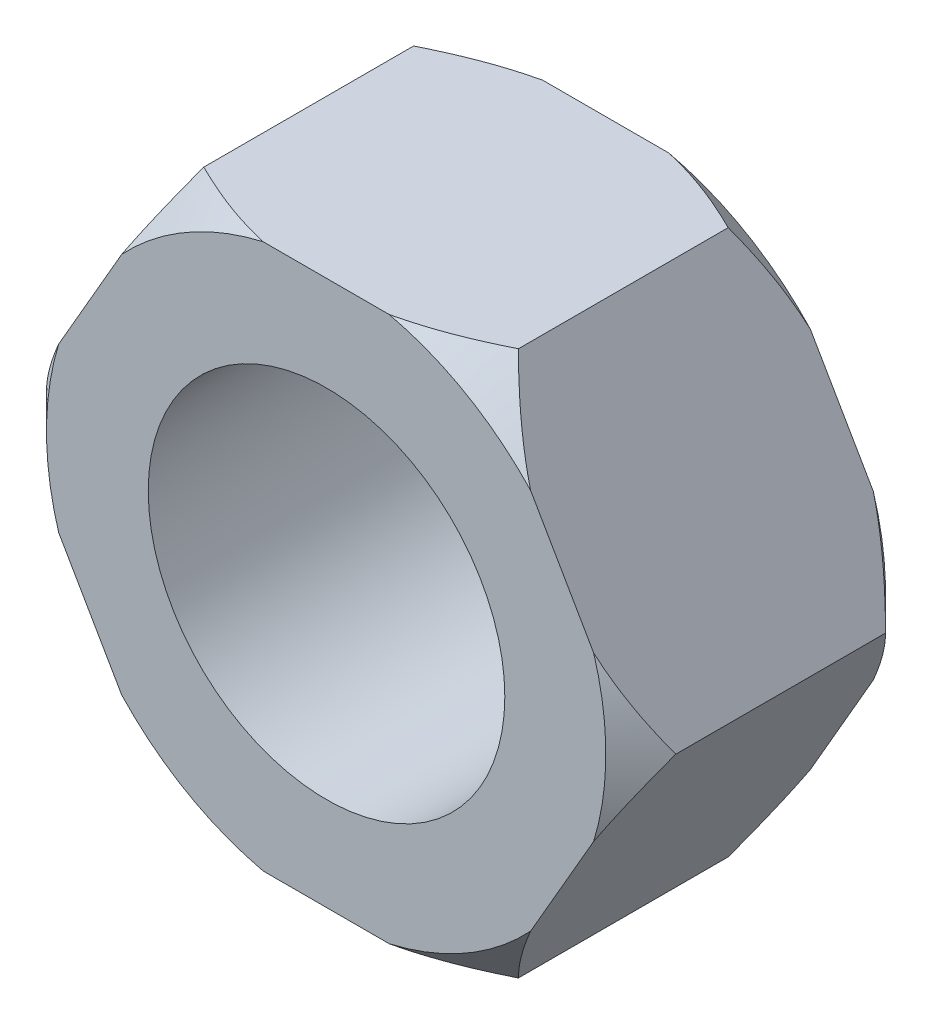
ISO-10303-21;
HEADER;
FILE_DESCRIPTION(('STEP AP214'),'2;1');
FILE_NAME('part.step','',(''),(''),'','','');
FILE_SCHEMA(('AUTOMOTIVE_DESIGN { 1 0 10303 214 1 1 1 1 }'));
ENDSEC;
DATA;
#1=APPLICATION_CONTEXT('core data for automotive mechanical design processes');
#2=APPLICATION_PROTOCOL_DEFINITION('international standard','automotive_design',2000,#1);
#3=PRODUCT_CONTEXT('',#1,'mechanical');
#4=PRODUCT('Part','Part','',(#3));
#5=PRODUCT_RELATED_PRODUCT_CATEGORY('part','',(#4));
#6=PRODUCT_DEFINITION_FORMATION('','',#4);
#7=PRODUCT_DEFINITION_CONTEXT('part definition',#1,'design');
#8=PRODUCT_DEFINITION('design','',#6,#7);
#9=PRODUCT_DEFINITION_SHAPE('','',#8);
#10=(LENGTH_UNIT() NAMED_UNIT(*) SI_UNIT(.MILLI.,.METRE.));
#11=(NAMED_UNIT(*) PLANE_ANGLE_UNIT() SI_UNIT($,.RADIAN.));
#12=(NAMED_UNIT(*) SI_UNIT($,.STERADIAN.) SOLID_ANGLE_UNIT());
#13=UNCERTAINTY_MEASURE_WITH_UNIT(LENGTH_MEASURE(1.E-05),#10,'distance_accuracy_value','');
#14=(GEOMETRIC_REPRESENTATION_CONTEXT(3) GLOBAL_UNCERTAINTY_ASSIGNED_CONTEXT((#13)) GLOBAL_UNIT_ASSIGNED_CONTEXT((#10,
#11,#12)) REPRESENTATION_CONTEXT('',''));
#15=CARTESIAN_POINT('',(0.,0.,0.));
#16=DIRECTION('',(0.,0.,1.));
#17=DIRECTION('',(1.,0.,0.));
#18=AXIS2_PLACEMENT_3D('',#15,#16,#17);
#19=CARTESIAN_POINT('',(0.,0.,8.));
#20=DIRECTION('',(0.,0.,1.));
#21=DIRECTION('',(1.,0.,0.));
#22=AXIS2_PLACEMENT_3D('',#19,#20,#21);
#23=PLANE('',#22);
#24=CARTESIAN_POINT('',(0.0104738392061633,-0.0209476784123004,8.));
#25=DIRECTION('',(0.,0.,1.));
#26=DIRECTION('',(1.,0.,0.));
#27=AXIS2_PLACEMENT_3D('',#24,#25,#26);
#28=CIRCLE('',#27,5.1);
#29=CARTESIAN_POINT('',(5.11047383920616,-0.0209476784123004,8.));
#30=VERTEX_POINT('',#29);
#31=EDGE_CURVE('E344',#30,#30,#28,.T.);
#32=ORIENTED_EDGE('',*,*,#31,.F.);
#33=EDGE_LOOP('',(#32));
#34=FACE_BOUND('',#33,.T.);
#35=CARTESIAN_POINT('',(0.,0.,8.));
#36=DIRECTION('',(0.,0.,1.));
#37=DIRECTION('',(1.,0.,0.));
#38=AXIS2_PLACEMENT_3D('',#35,#36,#37);
#39=CIRCLE('',#38,8.);
#40=CARTESIAN_POINT('',(1.80277563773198,-7.79422863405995,8.));
#41=VERTEX_POINT('',#40);
#42=CARTESIAN_POINT('',(5.84861218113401,-5.45836381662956,8.));
#43=VERTEX_POINT('',#42);
#44=EDGE_CURVE('E184',#41,#43,#39,.T.);
#45=ORIENTED_EDGE('',*,*,#44,.T.);
#46=DIRECTION('',(0.5,0.866025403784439,0.));
#47=VECTOR('',#46,1.);
#48=CARTESIAN_POINT('',(4.5,-7.79422863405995,8.));
#49=LINE('',#48,#47);
#50=CARTESIAN_POINT('',(7.65138781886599,-2.33586481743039,8.));
#51=VERTEX_POINT('',#50);
#52=EDGE_CURVE('E173',#43,#51,#49,.T.);
#53=ORIENTED_EDGE('',*,*,#52,.T.);
#54=CARTESIAN_POINT('',(7.65138781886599,2.33586481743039,8.));
#55=VERTEX_POINT('',#54);
#56=EDGE_CURVE('E179',#51,#55,#39,.T.);
#57=ORIENTED_EDGE('',*,*,#56,.T.);
#58=DIRECTION('',(-0.5,0.866025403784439,0.));
#59=VECTOR('',#58,1.);
#60=CARTESIAN_POINT('',(9.,0.,8.));
#61=LINE('',#60,#59);
#62=CARTESIAN_POINT('',(5.84861218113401,5.45836381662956,8.));
#63=VERTEX_POINT('',#62);
#64=EDGE_CURVE('E162',#55,#63,#61,.T.);
#65=ORIENTED_EDGE('',*,*,#64,.T.);
#66=CARTESIAN_POINT('',(1.80277563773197,7.79422863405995,8.));
#67=VERTEX_POINT('',#66);
#68=EDGE_CURVE('E187',#63,#67,#39,.T.);
#69=ORIENTED_EDGE('',*,*,#68,.T.);
#70=DIRECTION('',(-1.,0.,0.));
#71=VECTOR('',#70,1.);
#72=CARTESIAN_POINT('',(4.5,7.79422863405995,8.));
#73=LINE('',#72,#71);
#74=CARTESIAN_POINT('',(-1.80277563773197,7.79422863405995,8.));
#75=VERTEX_POINT('',#74);
#76=EDGE_CURVE('E172',#67,#75,#73,.T.);
#77=ORIENTED_EDGE('',*,*,#76,.T.);
#78=CARTESIAN_POINT('',(-5.84861218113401,5.45836381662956,8.));
#79=VERTEX_POINT('',#78);
#80=EDGE_CURVE('E193',#75,#79,#39,.T.);
#81=ORIENTED_EDGE('',*,*,#80,.T.);
#82=DIRECTION('',(-0.5,-0.866025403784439,0.));
#83=VECTOR('',#82,1.);
#84=CARTESIAN_POINT('',(-4.5,7.79422863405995,8.));
#85=LINE('',#84,#83);
#86=CARTESIAN_POINT('',(-7.65138781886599,2.33586481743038,8.));
#87=VERTEX_POINT('',#86);
#88=EDGE_CURVE('E378',#79,#87,#85,.T.);
#89=ORIENTED_EDGE('',*,*,#88,.T.);
#90=CARTESIAN_POINT('',(-7.65138781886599,-2.33586481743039,8.));
#91=VERTEX_POINT('',#90);
#92=EDGE_CURVE('E196',#87,#91,#39,.T.);
#93=ORIENTED_EDGE('',*,*,#92,.T.);
#94=DIRECTION('',(0.5,-0.866025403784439,0.));
#95=VECTOR('',#94,1.);
#96=CARTESIAN_POINT('',(-9.,0.,8.));
#97=LINE('',#96,#95);
#98=CARTESIAN_POINT('',(-5.84861218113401,-5.45836381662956,8.));
#99=VERTEX_POINT('',#98);
#100=EDGE_CURVE('E207',#91,#99,#97,.T.);
#101=ORIENTED_EDGE('',*,*,#100,.T.);
#102=CARTESIAN_POINT('',(-1.80277563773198,-7.79422863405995,8.));
#103=VERTEX_POINT('',#102);
#104=EDGE_CURVE('E188',#99,#103,#39,.T.);
#105=ORIENTED_EDGE('',*,*,#104,.T.);
#106=DIRECTION('',(1.,0.,0.));
#107=VECTOR('',#106,1.);
#108=CARTESIAN_POINT('',(-4.5,-7.79422863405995,8.));
#109=LINE('',#108,#107);
#110=EDGE_CURVE('E205',#103,#41,#109,.T.);
#111=ORIENTED_EDGE('',*,*,#110,.T.);
#112=EDGE_LOOP('',(#45,#53,#57,#65,#69,#77,#81,#89,#93,#101,#105,#111));
#113=FACE_BOUND('',#112,.T.);
#114=ADVANCED_FACE('F32',(#34,#113),#23,.T.);
#115=CARTESIAN_POINT('',(0.,0.,0.));
#116=DIRECTION('',(0.,0.,1.));
#117=DIRECTION('',(1.,0.,0.));
#118=AXIS2_PLACEMENT_3D('',#115,#116,#117);
#119=PLANE('',#118);
#120=CARTESIAN_POINT('',(0.0104738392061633,-0.0209476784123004,0.));
#121=DIRECTION('',(0.,0.,1.));
#122=DIRECTION('',(1.,0.,0.));
#123=AXIS2_PLACEMENT_3D('',#120,#121,#122);
#124=CIRCLE('',#123,5.1);
#125=CARTESIAN_POINT('',(5.11047383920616,-0.0209476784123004,0.));
#126=VERTEX_POINT('',#125);
#127=EDGE_CURVE('E346',#126,#126,#124,.T.);
#128=ORIENTED_EDGE('',*,*,#127,.T.);
#129=EDGE_LOOP('',(#128));
#130=FACE_BOUND('',#129,.T.);
#131=DIRECTION('',(0.5,0.866025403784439,0.));
#132=VECTOR('',#131,1.);
#133=CARTESIAN_POINT('',(6.75,-3.89711431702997,0.));
#134=LINE('',#133,#132);
#135=CARTESIAN_POINT('',(5.84861218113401,-5.45836381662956,0.));
#136=VERTEX_POINT('',#135);
#137=CARTESIAN_POINT('',(7.65138781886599,-2.33586481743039,0.));
#138=VERTEX_POINT('',#137);
#139=EDGE_CURVE('E302',#136,#138,#134,.T.);
#140=ORIENTED_EDGE('',*,*,#139,.F.);
#141=CARTESIAN_POINT('',(0.,0.,0.));
#142=DIRECTION('',(0.,0.,1.));
#143=DIRECTION('',(1.,0.,0.));
#144=AXIS2_PLACEMENT_3D('',#141,#142,#143);
#145=CIRCLE('',#144,8.);
#146=CARTESIAN_POINT('',(1.80277563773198,-7.79422863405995,0.));
#147=VERTEX_POINT('',#146);
#148=EDGE_CURVE('E185',#136,#147,#145,.F.);
#149=ORIENTED_EDGE('',*,*,#148,.T.);
#150=DIRECTION('',(1.,0.,0.));
#151=VECTOR('',#150,1.);
#152=CARTESIAN_POINT('',(0.,-7.79422863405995,0.));
#153=LINE('',#152,#151);
#154=CARTESIAN_POINT('',(-1.80277563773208,-7.79422863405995,0.));
#155=VERTEX_POINT('',#154);
#156=EDGE_CURVE('E293',#155,#147,#153,.T.);
#157=ORIENTED_EDGE('',*,*,#156,.F.);
#158=CARTESIAN_POINT('',(-5.84861218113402,-5.45836381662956,0.));
#159=VERTEX_POINT('',#158);
#160=EDGE_CURVE('E190',#155,#159,#145,.F.);
#161=ORIENTED_EDGE('',*,*,#160,.T.);
#162=DIRECTION('',(0.5,-0.866025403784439,0.));
#163=VECTOR('',#162,1.);
#164=CARTESIAN_POINT('',(-6.75,-3.89711431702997,0.));
#165=LINE('',#164,#163);
#166=CARTESIAN_POINT('',(-7.65138781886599,-2.33586481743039,0.));
#167=VERTEX_POINT('',#166);
#168=EDGE_CURVE('E248',#167,#159,#165,.T.);
#169=ORIENTED_EDGE('',*,*,#168,.F.);
#170=CARTESIAN_POINT('',(-7.65138781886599,2.33586481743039,0.));
#171=VERTEX_POINT('',#170);
#172=EDGE_CURVE('E397',#167,#171,#145,.F.);
#173=ORIENTED_EDGE('',*,*,#172,.T.);
#174=DIRECTION('',(-0.5,-0.866025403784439,0.));
#175=VECTOR('',#174,1.);
#176=CARTESIAN_POINT('',(-6.75,3.89711431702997,0.));
#177=LINE('',#176,#175);
#178=CARTESIAN_POINT('',(-5.84861218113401,5.45836381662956,0.));
#179=VERTEX_POINT('',#178);
#180=EDGE_CURVE('E251',#179,#171,#177,.T.);
#181=ORIENTED_EDGE('',*,*,#180,.F.);
#182=CARTESIAN_POINT('',(-1.80277563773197,7.79422863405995,0.));
#183=VERTEX_POINT('',#182);
#184=EDGE_CURVE('E399',#179,#183,#145,.F.);
#185=ORIENTED_EDGE('',*,*,#184,.T.);
#186=DIRECTION('',(-1.,0.,0.));
#187=VECTOR('',#186,1.);
#188=CARTESIAN_POINT('',(0.,7.79422863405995,0.));
#189=LINE('',#188,#187);
#190=CARTESIAN_POINT('',(1.80277563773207,7.79422863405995,0.));
#191=VERTEX_POINT('',#190);
#192=EDGE_CURVE('E406',#191,#183,#189,.T.);
#193=ORIENTED_EDGE('',*,*,#192,.F.);
#194=CARTESIAN_POINT('',(5.84861218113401,5.45836381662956,0.));
#195=VERTEX_POINT('',#194);
#196=EDGE_CURVE('E349',#191,#195,#145,.F.);
#197=ORIENTED_EDGE('',*,*,#196,.T.);
#198=DIRECTION('',(-0.5,0.866025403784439,0.));
#199=VECTOR('',#198,1.);
#200=CARTESIAN_POINT('',(6.75,3.89711431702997,0.));
#201=LINE('',#200,#199);
#202=CARTESIAN_POINT('',(7.65138781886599,2.33586481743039,0.));
#203=VERTEX_POINT('',#202);
#204=EDGE_CURVE('E367',#203,#195,#201,.T.);
#205=ORIENTED_EDGE('',*,*,#204,.F.);
#206=EDGE_CURVE('E192',#203,#138,#145,.F.);
#207=ORIENTED_EDGE('',*,*,#206,.T.);
#208=EDGE_LOOP('',(#140,#149,#157,#161,#169,#173,#181,#185,#193,#197,#205,#207));
#209=FACE_BOUND('',#208,.T.);
#210=ADVANCED_FACE('F259',(#130,#209),#119,.F.);
#211=CARTESIAN_POINT('',(0.,0.,0.999999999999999));
#212=DIRECTION('',(0.,0.,1.));
#213=DIRECTION('',(1.,0.,0.));
#214=AXIS2_PLACEMENT_3D('',#211,#212,#213);
#215=CONICAL_SURFACE('',#214,9.,0.78539816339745);
#216=ORIENTED_EDGE('',*,*,#148,.F.);
#217=CARTESIAN_POINT('',(12.1369928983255,5.43343108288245,5.29769791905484));
#218=CARTESIAN_POINT('',(12.0302747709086,5.2485898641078,5.12478921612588));
#219=CARTESIAN_POINT('',(11.923132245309,5.063013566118,4.95291872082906));
#220=CARTESIAN_POINT('',(11.7078511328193,4.69013574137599,4.61165240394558));
#221=CARTESIAN_POINT('',(11.5997124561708,4.50283405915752,4.44225680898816));
#222=CARTESIAN_POINT('',(11.3820509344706,4.12583324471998,4.10596813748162));
#223=CARTESIAN_POINT('',(11.2725253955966,3.9361294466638,3.9390820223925));
#224=CARTESIAN_POINT('',(11.0521782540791,3.55447700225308,3.60877516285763));
#225=CARTESIAN_POINT('',(10.9413566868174,3.36252841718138,3.44535432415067));
#226=CARTESIAN_POINT('',(10.7151159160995,2.97066790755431,3.11815964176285));
#227=CARTESIAN_POINT('',(10.5996545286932,2.77068291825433,2.95450218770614));
#228=CARTESIAN_POINT('',(10.3669019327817,2.36754359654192,2.63248142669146));
#229=CARTESIAN_POINT('',(10.2496107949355,2.16438938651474,2.47411791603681));
#230=CARTESIAN_POINT('',(10.0130018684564,1.7545707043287,2.16399537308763));
#231=CARTESIAN_POINT('',(9.89368590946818,1.54790940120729,2.01223077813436));
#232=CARTESIAN_POINT('',(9.65261140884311,1.13035611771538,1.71670343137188));
#233=CARTESIAN_POINT('',(9.53085318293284,0.919464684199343,1.57293965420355));
#234=CARTESIAN_POINT('',(9.28178338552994,0.48806314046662,1.29227723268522));
#235=CARTESIAN_POINT('',(9.15440853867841,0.267443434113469,1.1556017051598));
#236=CARTESIAN_POINT('',(8.89630886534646,-0.179598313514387,0.89532944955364));
#237=CARTESIAN_POINT('',(8.76558356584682,-0.406021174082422,0.771734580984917));
#238=CARTESIAN_POINT('',(8.5012203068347,-0.863911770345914,0.541706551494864));
#239=CARTESIAN_POINT('',(8.3676020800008,-1.09534532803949,0.435183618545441));
#240=CARTESIAN_POINT('',(8.09670837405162,-1.5645469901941,0.242602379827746));
#241=CARTESIAN_POINT('',(7.95943400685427,-1.80231316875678,0.156537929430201));
#242=CARTESIAN_POINT('',(7.70854534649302,-2.23686507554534,0.0236296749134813));
#243=CARTESIAN_POINT('',(7.59551319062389,-2.43264251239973,-0.027584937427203));
#244=CARTESIAN_POINT('',(7.36774250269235,-2.82715291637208,-0.111631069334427));
#245=CARTESIAN_POINT('',(7.25300422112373,-3.02588544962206,-0.144465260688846));
#246=CARTESIAN_POINT('',(7.02272182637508,-3.42474625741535,-0.190063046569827));
#247=CARTESIAN_POINT('',(6.90717945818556,-3.62487150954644,-0.202861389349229));
#248=CARTESIAN_POINT('',(6.67598101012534,-4.0253189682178,-0.207794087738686));
#249=CARTESIAN_POINT('',(6.56032492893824,-4.22564117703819,-0.199928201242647));
#250=CARTESIAN_POINT('',(6.33012109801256,-4.62436590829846,-0.164016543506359));
#251=CARTESIAN_POINT('',(6.21557121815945,-4.82277212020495,-0.136024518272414));
#252=CARTESIAN_POINT('',(5.98801671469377,-5.21690808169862,-0.0613574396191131));
#253=CARTESIAN_POINT('',(5.87501221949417,-5.41263760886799,-0.01468084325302));
#254=CARTESIAN_POINT('',(5.65072759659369,-5.80110997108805,0.0954399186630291));
#255=CARTESIAN_POINT('',(5.53945370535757,-5.99384200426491,0.158934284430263));
#256=CARTESIAN_POINT('',(5.31924411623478,-6.37525620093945,0.300285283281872));
#257=CARTESIAN_POINT('',(5.21030830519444,-6.56393856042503,0.378141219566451));
#258=CARTESIAN_POINT('',(4.95587943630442,-7.00462228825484,0.576269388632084));
#259=CARTESIAN_POINT('',(4.81139533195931,-7.25487609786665,0.701704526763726));
#260=CARTESIAN_POINT('',(4.52651568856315,-7.7483021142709,0.970079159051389));
#261=CARTESIAN_POINT('',(4.38612249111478,-7.99147026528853,1.11302844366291));
#262=CARTESIAN_POINT('',(4.10873649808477,-8.47191689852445,1.41278452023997));
#263=CARTESIAN_POINT('',(3.97175136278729,-8.70918211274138,1.56961945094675));
#264=CARTESIAN_POINT('',(3.70100273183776,-9.17813249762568,1.8938637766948));
#265=CARTESIAN_POINT('',(3.56723864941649,-9.40981868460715,2.06127122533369));
#266=CARTESIAN_POINT('',(3.30182239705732,-9.86953311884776,2.40522346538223));
#267=CARTESIAN_POINT('',(3.1701827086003,-10.0975397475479,2.58180660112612));
#268=CARTESIAN_POINT('',(2.909221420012,-10.5495379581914,2.94169154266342));
#269=CARTESIAN_POINT('',(2.77989990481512,-10.7735293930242,3.12499359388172));
#270=CARTESIAN_POINT('',(2.52335809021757,-11.2178728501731,3.49681707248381));
#271=CARTESIAN_POINT('',(2.39613573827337,-11.4382284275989,3.68533285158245));
#272=CARTESIAN_POINT('',(2.14336166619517,-11.8760459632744,4.06677078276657));
#273=CARTESIAN_POINT('',(2.01780990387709,-12.0935079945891,4.25969282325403));
#274=CARTESIAN_POINT('',(1.80378325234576,-12.4642130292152,4.59356128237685));
#275=CARTESIAN_POINT('',(1.71495978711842,-12.6180597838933,4.73361638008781));
#276=CARTESIAN_POINT('',(1.53833269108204,-12.9239868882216,5.01478278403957));
#277=CARTESIAN_POINT('',(1.45052635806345,-13.0760719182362,5.15588729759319));
#278=CARTESIAN_POINT('',(1.36300710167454,-13.2276597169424,5.29769791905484));
#279=B_SPLINE_CURVE_WITH_KNOTS('',3,(#217,#218,#219,#220,#221,#222,#223,#224,#225,#226,#227,
#228,#229,#230,#231,#232,#233,#234,#235,#236,#237,#238,#239,#240,#241,#242,#243,#244,#245,#246,
#247,#248,#249,#250,#251,#252,#253,#254,#255,#256,#257,#258,#259,#260,#261,#262,#263,#264,#265,
#266,#267,#268,#269,#270,#271,#272,#273,#274,#275,#276,#277,#278),.UNSPECIFIED.,.F.,.F.,(4,2,2,
2,2,2,2,2,2,2,2,2,2,2,2,2,2,2,2,2,2,2,2,2,2,2,2,2,2,2,4),(0.,0.824063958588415,1.64820291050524,
2.47431474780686,3.30040408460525,4.1494497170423,4.99846264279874,5.84674542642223,
6.69491924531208,7.5619134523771,8.42903074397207,9.29142708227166,10.1535640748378,
10.8482796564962,11.5428942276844,12.236302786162,12.9297194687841,13.6212912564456,
14.3129201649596,15.0066372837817,15.7003207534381,16.6445803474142,17.5893702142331,
18.5361205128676,19.4826970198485,20.4336097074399,21.3845571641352,22.3345119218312,
23.2844426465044,23.9630826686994,24.6389071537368),.UNSPECIFIED.);
#280=CARTESIAN_POINT('',(4.5,-7.79422863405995,1.));
#281=VERTEX_POINT('',#280);
#282=EDGE_CURVE('E295',#136,#281,#279,.T.);
#283=ORIENTED_EDGE('',*,*,#282,.T.);
#284=CARTESIAN_POINT('',(9.93343108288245,-7.79422863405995,4.6262842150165));
#285=CARTESIAN_POINT('',(9.71060973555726,-7.79422863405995,4.45101595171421));
#286=CARTESIAN_POINT('',(9.48671705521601,-7.79422863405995,4.2770922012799));
#287=CARTESIAN_POINT('',(9.03637435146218,-7.79422863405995,3.93251157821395));
#288=CARTESIAN_POINT('',(8.80992390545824,-7.79422863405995,3.76185525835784));
#289=CARTESIAN_POINT('',(8.35296778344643,-7.79422863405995,3.423589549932));
#290=CARTESIAN_POINT('',(8.12244735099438,-7.79422863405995,3.25600004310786));
#291=CARTESIAN_POINT('',(7.6580202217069,-7.79422863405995,2.92559495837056));
#292=CARTESIAN_POINT('',(7.42411369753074,-7.79422863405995,2.76277913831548));
#293=CARTESIAN_POINT('',(6.94065826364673,-7.79422863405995,2.43501786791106));
#294=CARTESIAN_POINT('',(6.69090880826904,-7.79422863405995,2.27036709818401));
#295=CARTESIAN_POINT('',(6.18629822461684,-7.79422863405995,1.94899147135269));
#296=CARTESIAN_POINT('',(5.93143652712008,-7.79422863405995,1.79226750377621));
#297=CARTESIAN_POINT('',(5.41631281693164,-7.79422863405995,1.48910731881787));
#298=CARTESIAN_POINT('',(5.15606251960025,-7.79422863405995,1.34265131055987));
#299=CARTESIAN_POINT('',(4.62888332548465,-7.79422863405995,1.06237966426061));
#300=CARTESIAN_POINT('',(4.36195650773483,-7.79422863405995,0.928560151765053));
#301=CARTESIAN_POINT('',(3.84872020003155,-7.79422863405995,0.690026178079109));
#302=CARTESIAN_POINT('',(3.60315022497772,-7.79422863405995,0.583732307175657));
#303=CARTESIAN_POINT('',(3.10561896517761,-7.79422863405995,0.38705388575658));
#304=CARTESIAN_POINT('',(2.85365706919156,-7.79422863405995,0.296670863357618));
#305=CARTESIAN_POINT('',(2.34645302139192,-7.79422863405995,0.136257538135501));
#306=CARTESIAN_POINT('',(2.09128238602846,-7.79422863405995,0.0660041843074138));
#307=CARTESIAN_POINT('',(1.57574582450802,-7.79422863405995,-0.0520385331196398));
#308=CARTESIAN_POINT('',(1.3153805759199,-7.79422863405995,-0.0998308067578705));
#309=CARTESIAN_POINT('',(0.78632072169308,-7.79422863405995,-0.170670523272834));
#310=CARTESIAN_POINT('',(0.517561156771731,-7.79422863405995,-0.193243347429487));
#311=CARTESIAN_POINT('',(-0.0208437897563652,-7.79422863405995,-0.210387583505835));
#312=CARTESIAN_POINT('',(-0.290489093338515,-7.79422863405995,-0.204961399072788));
#313=CARTESIAN_POINT('',(-0.828594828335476,-7.79422863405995,-0.166463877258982));
#314=CARTESIAN_POINT('',(-1.09704905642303,-7.79422863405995,-0.133307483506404));
#315=CARTESIAN_POINT('',(-1.62955227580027,-7.79422863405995,-0.0415746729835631));
#316=CARTESIAN_POINT('',(-1.89360006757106,-7.79422863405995,0.0170085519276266));
#317=CARTESIAN_POINT('',(-2.49723984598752,-7.79422863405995,0.177845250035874));
#318=CARTESIAN_POINT('',(-2.83470390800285,-7.79422863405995,0.288020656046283));
#319=CARTESIAN_POINT('',(-3.4984813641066,-7.79422863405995,0.537829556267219));
#320=CARTESIAN_POINT('',(-3.82478789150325,-7.79422863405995,0.677480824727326));
#321=CARTESIAN_POINT('',(-4.4691522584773,-7.79422863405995,0.980079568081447));
#322=CARTESIAN_POINT('',(-4.78713337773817,-7.79422863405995,1.14318821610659));
#323=CARTESIAN_POINT('',(-5.41366422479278,-7.79422863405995,1.48625814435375));
#324=CARTESIAN_POINT('',(-5.7222161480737,-7.79422863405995,1.66621546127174));
#325=CARTESIAN_POINT('',(-6.37142943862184,-7.79422863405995,2.06333734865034));
#326=CARTESIAN_POINT('',(-6.71099229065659,-7.79422863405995,2.28228581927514));
#327=CARTESIAN_POINT('',(-7.38202495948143,-7.79422863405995,2.73230756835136));
#328=CARTESIAN_POINT('',(-7.7134930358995,-7.79422863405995,2.96338342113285));
#329=CARTESIAN_POINT('',(-8.36262338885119,-7.79422863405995,3.42950591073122));
#330=CARTESIAN_POINT('',(-8.68042898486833,-7.79422863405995,3.66435376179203));
#331=CARTESIAN_POINT('',(-9.15316201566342,-7.79422863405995,4.02163810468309));
#332=CARTESIAN_POINT('',(-9.3100257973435,-7.79422863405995,4.14152774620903));
#333=CARTESIAN_POINT('',(-9.62257828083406,-7.79422863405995,4.38281724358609));
#334=CARTESIAN_POINT('',(-9.77826702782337,-7.79422863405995,4.50421704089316));
#335=CARTESIAN_POINT('',(-9.93343108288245,-7.79422863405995,4.6262842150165));
#336=B_SPLINE_CURVE_WITH_KNOTS('',3,(#284,#285,#286,#287,#288,#289,#290,#291,#292,#293,#294,
#295,#296,#297,#298,#299,#300,#301,#302,#303,#304,#305,#306,#307,#308,#309,#310,#311,#312,#313,
#314,#315,#316,#317,#318,#319,#320,#321,#322,#323,#324,#325,#326,#327,#328,#329,#330,#331,#332,
#333,#334,#335),.UNSPECIFIED.,.F.,.F.,(4,2,2,2,2,2,2,2,2,2,2,2,2,2,2,2,2,2,2,2,2,2,2,2,2,4),(0.,
0.850490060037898,1.70112275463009,2.55607654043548,3.41098688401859,4.30828598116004,
5.20568554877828,6.10130496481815,6.99664887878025,7.79896336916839,8.60135487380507,
9.39447724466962,10.187496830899,10.9952017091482,11.8028372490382,12.6129591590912,
13.4232981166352,14.4864105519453,15.5501658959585,16.6216142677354,17.6928112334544,
18.9045499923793,20.1165470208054,21.3019154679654,21.8942071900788,22.4864760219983),.UNSPECIFIED.);
#337=EDGE_CURVE('E294',#281,#147,#336,.T.);
#338=ORIENTED_EDGE('',*,*,#337,.T.);
#339=EDGE_LOOP('',(#216,#283,#338));
#340=FACE_BOUND('',#339,.T.);
#341=ADVANCED_FACE('F254',(#340),#215,.T.);
#342=ORIENTED_EDGE('',*,*,#160,.F.);
#343=CARTESIAN_POINT('',(-4.5,-7.79422863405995,0.999999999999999));
#344=VERTEX_POINT('',#343);
#345=EDGE_CURVE('E287',#155,#344,#336,.T.);
#346=ORIENTED_EDGE('',*,*,#345,.T.);
#347=CARTESIAN_POINT('',(-1.36300710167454,-13.2276597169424,5.29769791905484));
#348=CARTESIAN_POINT('',(-1.46972522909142,-13.0428184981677,5.12478921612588));
#349=CARTESIAN_POINT('',(-1.57686775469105,-12.8572422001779,4.95291872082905));
#350=CARTESIAN_POINT('',(-1.79214886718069,-12.4843643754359,4.61165240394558));
#351=CARTESIAN_POINT('',(-1.90028754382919,-12.2970626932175,4.44225680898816));
#352=CARTESIAN_POINT('',(-2.11794906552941,-11.9200618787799,4.10596813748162));
#353=CARTESIAN_POINT('',(-2.22747460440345,-11.7303580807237,3.9390820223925));
#354=CARTESIAN_POINT('',(-2.44782174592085,-11.348705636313,3.60877516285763));
#355=CARTESIAN_POINT('',(-2.55864331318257,-11.1567570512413,3.44535432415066));
#356=CARTESIAN_POINT('',(-2.78488408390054,-10.7648965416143,3.11815964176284));
#357=CARTESIAN_POINT('',(-2.90034547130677,-10.5649115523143,2.95450218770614));
#358=CARTESIAN_POINT('',(-3.13309806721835,-10.1617722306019,2.63248142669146));
#359=CARTESIAN_POINT('',(-3.25038920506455,-9.95861802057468,2.4741179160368));
#360=CARTESIAN_POINT('',(-3.4869981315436,-9.54879933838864,2.16399537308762));
#361=CARTESIAN_POINT('',(-3.60631409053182,-9.34213803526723,2.01223077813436));
#362=CARTESIAN_POINT('',(-3.84738859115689,-8.92458475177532,1.71670343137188));
#363=CARTESIAN_POINT('',(-3.96914681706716,-8.71369331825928,1.57293965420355));
#364=CARTESIAN_POINT('',(-4.21821661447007,-8.28229177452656,1.29227723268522));
#365=CARTESIAN_POINT('',(-4.34559146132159,-8.06167206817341,1.1556017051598));
#366=CARTESIAN_POINT('',(-4.60369113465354,-7.61463032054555,0.895329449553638));
#367=CARTESIAN_POINT('',(-4.73441643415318,-7.38820745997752,0.771734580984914));
#368=CARTESIAN_POINT('',(-4.9987796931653,-6.93031686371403,0.541706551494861));
#369=CARTESIAN_POINT('',(-5.1323979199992,-6.69888330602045,0.435183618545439));
#370=CARTESIAN_POINT('',(-5.40329162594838,-6.22968164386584,0.242602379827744));
#371=CARTESIAN_POINT('',(-5.54056599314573,-5.99191546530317,0.156537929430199));
#372=CARTESIAN_POINT('',(-5.79145465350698,-5.5573635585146,0.0236296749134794));
#373=CARTESIAN_POINT('',(-5.90448680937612,-5.36158612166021,-0.0275849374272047));
#374=CARTESIAN_POINT('',(-6.13225749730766,-4.96707571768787,-0.111631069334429));
#375=CARTESIAN_POINT('',(-6.24699577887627,-4.76834318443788,-0.144465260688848));
#376=CARTESIAN_POINT('',(-6.47727817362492,-4.36948237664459,-0.190063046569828));
#377=CARTESIAN_POINT('',(-6.59282054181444,-4.16935712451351,-0.202861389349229));
#378=CARTESIAN_POINT('',(-6.82401898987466,-3.76890966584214,-0.207794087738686));
#379=CARTESIAN_POINT('',(-6.93967507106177,-3.56858745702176,-0.199928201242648));
#380=CARTESIAN_POINT('',(-7.16987890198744,-3.16986272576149,-0.164016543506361));
#381=CARTESIAN_POINT('',(-7.28442878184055,-2.97145651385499,-0.136024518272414));
#382=CARTESIAN_POINT('',(-7.51198328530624,-2.57732055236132,-0.0613574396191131));
#383=CARTESIAN_POINT('',(-7.62498778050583,-2.38159102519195,-0.0146808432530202));
#384=CARTESIAN_POINT('',(-7.84927240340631,-1.99311866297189,0.0954399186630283));
#385=CARTESIAN_POINT('',(-7.96054629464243,-1.80038662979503,0.158934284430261));
#386=CARTESIAN_POINT('',(-8.18075588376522,-1.41897243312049,0.300285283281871));
#387=CARTESIAN_POINT('',(-8.28969169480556,-1.23029007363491,0.378141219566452));
#388=CARTESIAN_POINT('',(-8.54412056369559,-0.789606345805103,0.576269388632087));
#389=CARTESIAN_POINT('',(-8.6886046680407,-0.539352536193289,0.701704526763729));
#390=CARTESIAN_POINT('',(-8.97348431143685,-0.0459265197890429,0.970079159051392));
#391=CARTESIAN_POINT('',(-9.11387750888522,0.197241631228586,1.11302844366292));
#392=CARTESIAN_POINT('',(-9.39126350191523,0.677688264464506,1.41278452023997));
#393=CARTESIAN_POINT('',(-9.52824863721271,0.914953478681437,1.56961945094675));
#394=CARTESIAN_POINT('',(-9.79899726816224,1.38390386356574,1.89386377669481));
#395=CARTESIAN_POINT('',(-9.93276135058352,1.61559005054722,2.06127122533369));
#396=CARTESIAN_POINT('',(-10.1981776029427,2.07530448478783,2.40522346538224));
#397=CARTESIAN_POINT('',(-10.3298172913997,2.30331111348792,2.58180660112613));
#398=CARTESIAN_POINT('',(-10.590778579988,2.75530932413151,2.94169154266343));
#399=CARTESIAN_POINT('',(-10.7201000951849,2.97930075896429,3.12499359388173));
#400=CARTESIAN_POINT('',(-10.9766419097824,3.42364421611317,3.49681707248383));
#401=CARTESIAN_POINT('',(-11.1038642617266,3.64399979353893,3.68533285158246));
#402=CARTESIAN_POINT('',(-11.3566383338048,4.08181732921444,4.06677078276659));
#403=CARTESIAN_POINT('',(-11.4821900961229,4.29927936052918,4.25969282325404));
#404=CARTESIAN_POINT('',(-11.6962167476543,4.66998439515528,4.59356128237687));
#405=CARTESIAN_POINT('',(-11.7850402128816,4.82383114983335,4.73361638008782));
#406=CARTESIAN_POINT('',(-11.961667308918,5.1297582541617,5.01478278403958));
#407=CARTESIAN_POINT('',(-12.0494736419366,5.28184328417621,5.15588729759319));
#408=CARTESIAN_POINT('',(-12.1369928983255,5.43343108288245,5.29769791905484));
#409=B_SPLINE_CURVE_WITH_KNOTS('',3,(#347,#348,#349,#350,#351,#352,#353,#354,#355,#356,#357,
#358,#359,#360,#361,#362,#363,#364,#365,#366,#367,#368,#369,#370,#371,#372,#373,#374,#375,#376,
#377,#378,#379,#380,#381,#382,#383,#384,#385,#386,#387,#388,#389,#390,#391,#392,#393,#394,#395,
#396,#397,#398,#399,#400,#401,#402,#403,#404,#405,#406,#407,#408),.UNSPECIFIED.,.F.,.F.,(4,2,2,
2,2,2,2,2,2,2,2,2,2,2,2,2,2,2,2,2,2,2,2,2,2,2,2,2,2,2,4),(0.,0.824063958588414,1.64820291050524,
2.47431474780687,3.30040408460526,4.1494497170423,4.99846264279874,5.84674542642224,
6.69491924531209,7.56191345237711,8.42903074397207,9.29142708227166,10.1535640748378,
10.8482796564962,11.5428942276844,12.236302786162,12.9297194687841,13.6212912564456,
14.3129201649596,15.0066372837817,15.7003207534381,16.6445803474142,17.5893702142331,
18.5361205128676,19.4826970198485,20.4336097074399,21.3845571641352,22.3345119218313,
23.2844426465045,23.9630826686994,24.6389071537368),.UNSPECIFIED.);
#410=EDGE_CURVE('E250',#344,#159,#409,.T.);
#411=ORIENTED_EDGE('',*,*,#410,.T.);
#412=EDGE_LOOP('',(#342,#346,#411));
#413=FACE_BOUND('',#412,.T.);
#414=ADVANCED_FACE('F258',(#413),#215,.T.);
#415=ORIENTED_EDGE('',*,*,#172,.F.);
#416=CARTESIAN_POINT('',(-9.,0.,0.999999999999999));
#417=VERTEX_POINT('',#416);
#418=EDGE_CURVE('E241',#167,#417,#409,.T.);
#419=ORIENTED_EDGE('',*,*,#418,.T.);
#420=CARTESIAN_POINT('',(-12.1369928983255,-5.43343108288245,5.29769791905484));
#421=CARTESIAN_POINT('',(-12.0302747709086,-5.2485898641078,5.12478921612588));
#422=CARTESIAN_POINT('',(-11.923132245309,-5.063013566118,4.95291872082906));
#423=CARTESIAN_POINT('',(-11.7078511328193,-4.69013574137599,4.61165240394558));
#424=CARTESIAN_POINT('',(-11.5997124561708,-4.50283405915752,4.44225680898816));
#425=CARTESIAN_POINT('',(-11.3820509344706,-4.12583324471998,4.10596813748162));
#426=CARTESIAN_POINT('',(-11.2725253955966,-3.93612944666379,3.9390820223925));
#427=CARTESIAN_POINT('',(-11.0521782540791,-3.55447700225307,3.60877516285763));
#428=CARTESIAN_POINT('',(-10.9413566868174,-3.36252841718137,3.44535432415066));
#429=CARTESIAN_POINT('',(-10.7151159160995,-2.97066790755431,3.11815964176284));
#430=CARTESIAN_POINT('',(-10.5996545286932,-2.77068291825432,2.95450218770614));
#431=CARTESIAN_POINT('',(-10.3669019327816,-2.36754359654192,2.63248142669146));
#432=CARTESIAN_POINT('',(-10.2496107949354,-2.16438938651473,2.47411791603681));
#433=CARTESIAN_POINT('',(-10.0130018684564,-1.75457070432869,2.16399537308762));
#434=CARTESIAN_POINT('',(-9.89368590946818,-1.54790940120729,2.01223077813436));
#435=CARTESIAN_POINT('',(-9.65261140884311,-1.13035611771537,1.71670343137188));
#436=CARTESIAN_POINT('',(-9.53085318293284,-0.919464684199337,1.57293965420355));
#437=CARTESIAN_POINT('',(-9.28178338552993,-0.488063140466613,1.29227723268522));
#438=CARTESIAN_POINT('',(-9.15440853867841,-0.267443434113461,1.1556017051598));
#439=CARTESIAN_POINT('',(-8.89630886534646,0.179598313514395,0.895329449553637));
#440=CARTESIAN_POINT('',(-8.76558356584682,0.40602117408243,0.771734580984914));
#441=CARTESIAN_POINT('',(-8.5012203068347,0.86391177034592,0.541706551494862));
#442=CARTESIAN_POINT('',(-8.3676020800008,1.09534532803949,0.435183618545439));
#443=CARTESIAN_POINT('',(-8.09670837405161,1.56454699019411,0.242602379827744));
#444=CARTESIAN_POINT('',(-7.95943400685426,1.80231316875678,0.156537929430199));
#445=CARTESIAN_POINT('',(-7.70854534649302,2.23686507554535,0.02362967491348));
#446=CARTESIAN_POINT('',(-7.59551319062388,2.43264251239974,-0.0275849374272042));
#447=CARTESIAN_POINT('',(-7.36774250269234,2.82715291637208,-0.111631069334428));
#448=CARTESIAN_POINT('',(-7.25300422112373,3.02588544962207,-0.144465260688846));
#449=CARTESIAN_POINT('',(-7.02272182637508,3.42474625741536,-0.190063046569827));
#450=CARTESIAN_POINT('',(-6.90717945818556,3.62487150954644,-0.202861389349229));
#451=CARTESIAN_POINT('',(-6.67598101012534,4.02531896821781,-0.207794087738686));
#452=CARTESIAN_POINT('',(-6.56032492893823,4.22564117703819,-0.199928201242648));
#453=CARTESIAN_POINT('',(-6.33012109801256,4.62436590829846,-0.164016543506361));
#454=CARTESIAN_POINT('',(-6.21557121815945,4.82277212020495,-0.136024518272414));
#455=CARTESIAN_POINT('',(-5.98801671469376,5.21690808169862,-0.0613574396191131));
#456=CARTESIAN_POINT('',(-5.87501221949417,5.412637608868,-0.0146808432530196));
#457=CARTESIAN_POINT('',(-5.65072759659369,5.80110997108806,0.095439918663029));
#458=CARTESIAN_POINT('',(-5.53945370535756,5.99384200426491,0.158934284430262));
#459=CARTESIAN_POINT('',(-5.31924411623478,6.37525620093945,0.300285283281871));
#460=CARTESIAN_POINT('',(-5.21030830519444,6.56393856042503,0.378141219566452));
#461=CARTESIAN_POINT('',(-4.95587943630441,7.00462228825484,0.576269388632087));
#462=CARTESIAN_POINT('',(-4.8113953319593,7.25487609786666,0.70170452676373));
#463=CARTESIAN_POINT('',(-4.52651568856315,7.7483021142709,0.970079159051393));
#464=CARTESIAN_POINT('',(-4.38612249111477,7.99147026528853,1.11302844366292));
#465=CARTESIAN_POINT('',(-4.10873649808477,8.47191689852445,1.41278452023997));
#466=CARTESIAN_POINT('',(-3.97175136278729,8.70918211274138,1.56961945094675));
#467=CARTESIAN_POINT('',(-3.70100273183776,9.17813249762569,1.89386377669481));
#468=CARTESIAN_POINT('',(-3.56723864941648,9.40981868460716,2.06127122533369));
#469=CARTESIAN_POINT('',(-3.30182239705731,9.86953311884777,2.40522346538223));
#470=CARTESIAN_POINT('',(-3.17018270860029,10.0975397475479,2.58180660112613));
#471=CARTESIAN_POINT('',(-2.90922142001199,10.5495379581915,2.94169154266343));
#472=CARTESIAN_POINT('',(-2.77989990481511,10.7735293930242,3.12499359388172));
#473=CARTESIAN_POINT('',(-2.52335809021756,11.2178728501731,3.49681707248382));
#474=CARTESIAN_POINT('',(-2.39613573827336,11.4382284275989,3.68533285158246));
#475=CARTESIAN_POINT('',(-2.14336166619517,11.8760459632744,4.06677078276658));
#476=CARTESIAN_POINT('',(-2.01780990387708,12.0935079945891,4.25969282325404));
#477=CARTESIAN_POINT('',(-1.80378325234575,12.4642130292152,4.59356128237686));
#478=CARTESIAN_POINT('',(-1.71495978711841,12.6180597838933,4.73361638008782));
#479=CARTESIAN_POINT('',(-1.53833269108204,12.9239868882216,5.01478278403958));
#480=CARTESIAN_POINT('',(-1.45052635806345,13.0760719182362,5.15588729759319));
#481=CARTESIAN_POINT('',(-1.36300710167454,13.2276597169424,5.29769791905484));
#482=B_SPLINE_CURVE_WITH_KNOTS('',3,(#420,#421,#422,#423,#424,#425,#426,#427,#428,#429,#430,
#431,#432,#433,#434,#435,#436,#437,#438,#439,#440,#441,#442,#443,#444,#445,#446,#447,#448,#449,
#450,#451,#452,#453,#454,#455,#456,#457,#458,#459,#460,#461,#462,#463,#464,#465,#466,#467,#468,
#469,#470,#471,#472,#473,#474,#475,#476,#477,#478,#479,#480,#481),.UNSPECIFIED.,.F.,.F.,(4,2,2,
2,2,2,2,2,2,2,2,2,2,2,2,2,2,2,2,2,2,2,2,2,2,2,2,2,2,2,4),(0.,0.824063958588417,1.64820291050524,
2.47431474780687,3.30040408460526,4.14944971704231,4.99846264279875,5.84674542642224,
6.69491924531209,7.56191345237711,8.42903074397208,9.29142708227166,10.1535640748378,
10.8482796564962,11.5428942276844,12.236302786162,12.9297194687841,13.6212912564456,
14.3129201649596,15.0066372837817,15.7003207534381,16.6445803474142,17.5893702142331,
18.5361205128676,19.4826970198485,20.4336097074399,21.3845571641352,22.3345119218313,
23.2844426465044,23.9630826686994,24.6389071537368),.UNSPECIFIED.);
#483=EDGE_CURVE('E249',#417,#171,#482,.T.);
#484=ORIENTED_EDGE('',*,*,#483,.T.);
#485=EDGE_LOOP('',(#415,#419,#484));
#486=FACE_BOUND('',#485,.T.);
#487=ADVANCED_FACE('F395',(#486),#215,.T.);
#488=ORIENTED_EDGE('',*,*,#184,.F.);
#489=CARTESIAN_POINT('',(-4.5,7.79422863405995,1.));
#490=VERTEX_POINT('',#489);
#491=EDGE_CURVE('E283',#179,#490,#482,.T.);
#492=ORIENTED_EDGE('',*,*,#491,.T.);
#493=CARTESIAN_POINT('',(-9.93343108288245,7.79422863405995,4.6262842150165));
#494=CARTESIAN_POINT('',(-9.71060973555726,7.79422863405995,4.45101595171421));
#495=CARTESIAN_POINT('',(-9.48671705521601,7.79422863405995,4.27709220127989));
#496=CARTESIAN_POINT('',(-9.03637435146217,7.79422863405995,3.93251157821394));
#497=CARTESIAN_POINT('',(-8.80992390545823,7.79422863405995,3.76185525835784));
#498=CARTESIAN_POINT('',(-8.35296778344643,7.79422863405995,3.423589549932));
#499=CARTESIAN_POINT('',(-8.12244735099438,7.79422863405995,3.25600004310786));
#500=CARTESIAN_POINT('',(-7.6580202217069,7.79422863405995,2.92559495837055));
#501=CARTESIAN_POINT('',(-7.42411369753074,7.79422863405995,2.76277913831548));
#502=CARTESIAN_POINT('',(-6.94065826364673,7.79422863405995,2.43501786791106));
#503=CARTESIAN_POINT('',(-6.69090880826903,7.79422863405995,2.27036709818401));
#504=CARTESIAN_POINT('',(-6.18629822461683,7.79422863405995,1.94899147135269));
#505=CARTESIAN_POINT('',(-5.93143652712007,7.79422863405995,1.79226750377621));
#506=CARTESIAN_POINT('',(-5.41631281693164,7.79422863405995,1.48910731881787));
#507=CARTESIAN_POINT('',(-5.15606251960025,7.79422863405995,1.34265131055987));
#508=CARTESIAN_POINT('',(-4.62888332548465,7.79422863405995,1.06237966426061));
#509=CARTESIAN_POINT('',(-4.36195650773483,7.79422863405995,0.928560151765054));
#510=CARTESIAN_POINT('',(-3.84872020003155,7.79422863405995,0.690026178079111));
#511=CARTESIAN_POINT('',(-3.60315022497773,7.79422863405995,0.583732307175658));
#512=CARTESIAN_POINT('',(-3.10561896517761,7.79422863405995,0.38705388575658));
#513=CARTESIAN_POINT('',(-2.85365706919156,7.79422863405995,0.296670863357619));
#514=CARTESIAN_POINT('',(-2.34645302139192,7.79422863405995,0.136257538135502));
#515=CARTESIAN_POINT('',(-2.09128238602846,7.79422863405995,0.0660041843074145));
#516=CARTESIAN_POINT('',(-1.57574582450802,7.79422863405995,-0.0520385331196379));
#517=CARTESIAN_POINT('',(-1.3153805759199,7.79422863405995,-0.0998308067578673));
#518=CARTESIAN_POINT('',(-0.786320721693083,7.79422863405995,-0.17067052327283));
#519=CARTESIAN_POINT('',(-0.517561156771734,7.79422863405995,-0.193243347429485));
#520=CARTESIAN_POINT('',(0.0208437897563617,7.79422863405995,-0.210387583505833));
#521=CARTESIAN_POINT('',(0.290489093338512,7.79422863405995,-0.204961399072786));
#522=CARTESIAN_POINT('',(0.828594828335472,7.79422863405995,-0.166463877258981));
#523=CARTESIAN_POINT('',(1.09704905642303,7.79422863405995,-0.133307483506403));
#524=CARTESIAN_POINT('',(1.62955227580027,7.79422863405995,-0.0415746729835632));
#525=CARTESIAN_POINT('',(1.89360006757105,7.79422863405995,0.0170085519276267));
#526=CARTESIAN_POINT('',(2.49723984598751,7.79422863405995,0.177845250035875));
#527=CARTESIAN_POINT('',(2.83470390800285,7.79422863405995,0.288020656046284));
#528=CARTESIAN_POINT('',(3.4984813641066,7.79422863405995,0.537829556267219));
#529=CARTESIAN_POINT('',(3.82478789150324,7.79422863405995,0.677480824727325));
#530=CARTESIAN_POINT('',(4.46915225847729,7.79422863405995,0.980079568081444));
#531=CARTESIAN_POINT('',(4.78713337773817,7.79422863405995,1.14318821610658));
#532=CARTESIAN_POINT('',(5.41366422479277,7.79422863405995,1.48625814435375));
#533=CARTESIAN_POINT('',(5.72221614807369,7.79422863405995,1.66621546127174));
#534=CARTESIAN_POINT('',(6.37142943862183,7.79422863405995,2.06333734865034));
#535=CARTESIAN_POINT('',(6.71099229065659,7.79422863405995,2.28228581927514));
#536=CARTESIAN_POINT('',(7.38202495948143,7.79422863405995,2.73230756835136));
#537=CARTESIAN_POINT('',(7.71349303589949,7.79422863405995,2.96338342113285));
#538=CARTESIAN_POINT('',(8.36262338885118,7.79422863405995,3.42950591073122));
#539=CARTESIAN_POINT('',(8.68042898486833,7.79422863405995,3.66435376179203));
#540=CARTESIAN_POINT('',(9.15316201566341,7.79422863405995,4.02163810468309));
#541=CARTESIAN_POINT('',(9.31002579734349,7.79422863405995,4.14152774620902));
#542=CARTESIAN_POINT('',(9.62257828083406,7.79422863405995,4.38281724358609));
#543=CARTESIAN_POINT('',(9.77826702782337,7.79422863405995,4.50421704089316));
#544=CARTESIAN_POINT('',(9.93343108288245,7.79422863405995,4.6262842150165));
#545=B_SPLINE_CURVE_WITH_KNOTS('',3,(#493,#494,#495,#496,#497,#498,#499,#500,#501,#502,#503,
#504,#505,#506,#507,#508,#509,#510,#511,#512,#513,#514,#515,#516,#517,#518,#519,#520,#521,#522,
#523,#524,#525,#526,#527,#528,#529,#530,#531,#532,#533,#534,#535,#536,#537,#538,#539,#540,#541,
#542,#543,#544),.UNSPECIFIED.,.F.,.F.,(4,2,2,2,2,2,2,2,2,2,2,2,2,2,2,2,2,2,2,2,2,2,2,2,2,4),(0.,
0.850490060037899,1.7011227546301,2.55607654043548,3.41098688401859,4.30828598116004,
5.20568554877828,6.10130496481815,6.99664887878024,7.79896336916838,8.60135487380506,
9.39447724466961,10.1874968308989,10.9952017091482,11.8028372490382,12.6129591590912,
13.4232981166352,14.4864105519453,15.5501658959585,16.6216142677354,17.6928112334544,
18.9045499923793,20.1165470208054,21.3019154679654,21.8942071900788,22.4864760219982),.UNSPECIFIED.);
#546=EDGE_CURVE('E411',#490,#183,#545,.T.);
#547=ORIENTED_EDGE('',*,*,#546,.T.);
#548=EDGE_LOOP('',(#488,#492,#547));
#549=FACE_BOUND('',#548,.T.);
#550=ADVANCED_FACE('F419',(#549),#215,.T.);
#551=ORIENTED_EDGE('',*,*,#196,.F.);
#552=CARTESIAN_POINT('',(4.5,7.79422863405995,1.));
#553=VERTEX_POINT('',#552);
#554=EDGE_CURVE('E277',#191,#553,#545,.T.);
#555=ORIENTED_EDGE('',*,*,#554,.T.);
#556=CARTESIAN_POINT('',(1.36300710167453,13.2276597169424,5.29769791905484));
#557=CARTESIAN_POINT('',(1.46972522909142,13.0428184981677,5.12478921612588));
#558=CARTESIAN_POINT('',(1.57686775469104,12.857242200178,4.95291872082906));
#559=CARTESIAN_POINT('',(1.79214886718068,12.4843643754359,4.61165240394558));
#560=CARTESIAN_POINT('',(1.90028754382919,12.2970626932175,4.44225680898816));
#561=CARTESIAN_POINT('',(2.11794906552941,11.9200618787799,4.10596813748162));
#562=CARTESIAN_POINT('',(2.22747460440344,11.7303580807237,3.9390820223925));
#563=CARTESIAN_POINT('',(2.44782174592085,11.348705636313,3.60877516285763));
#564=CARTESIAN_POINT('',(2.55864331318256,11.1567570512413,3.44535432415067));
#565=CARTESIAN_POINT('',(2.78488408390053,10.7648965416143,3.11815964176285));
#566=CARTESIAN_POINT('',(2.90034547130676,10.5649115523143,2.95450218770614));
#567=CARTESIAN_POINT('',(3.13309806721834,10.1617722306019,2.63248142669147));
#568=CARTESIAN_POINT('',(3.25038920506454,9.95861802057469,2.47411791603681));
#569=CARTESIAN_POINT('',(3.48699813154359,9.54879933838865,2.16399537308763));
#570=CARTESIAN_POINT('',(3.60631409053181,9.34213803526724,2.01223077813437));
#571=CARTESIAN_POINT('',(3.84738859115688,8.92458475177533,1.71670343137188));
#572=CARTESIAN_POINT('',(3.96914681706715,8.7136933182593,1.57293965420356));
#573=CARTESIAN_POINT('',(4.21821661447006,8.28229177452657,1.29227723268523));
#574=CARTESIAN_POINT('',(4.34559146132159,8.06167206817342,1.1556017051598));
#575=CARTESIAN_POINT('',(4.60369113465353,7.61463032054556,0.895329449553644));
#576=CARTESIAN_POINT('',(4.73441643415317,7.38820745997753,0.77173458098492));
#577=CARTESIAN_POINT('',(4.9987796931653,6.93031686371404,0.541706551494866));
#578=CARTESIAN_POINT('',(5.13239791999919,6.69888330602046,0.435183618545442));
#579=CARTESIAN_POINT('',(5.40329162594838,6.22968164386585,0.242602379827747));
#580=CARTESIAN_POINT('',(5.54056599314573,5.99191546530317,0.156537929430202));
#581=CARTESIAN_POINT('',(5.79145465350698,5.5573635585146,0.0236296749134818));
#582=CARTESIAN_POINT('',(5.90448680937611,5.36158612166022,-0.0275849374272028));
#583=CARTESIAN_POINT('',(6.13225749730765,4.96707571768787,-0.111631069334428));
#584=CARTESIAN_POINT('',(6.24699577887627,4.76834318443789,-0.144465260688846));
#585=CARTESIAN_POINT('',(6.47727817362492,4.3694823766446,-0.190063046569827));
#586=CARTESIAN_POINT('',(6.59282054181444,4.16935712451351,-0.202861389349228));
#587=CARTESIAN_POINT('',(6.82401898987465,3.76890966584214,-0.207794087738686));
#588=CARTESIAN_POINT('',(6.93967507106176,3.56858745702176,-0.199928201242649));
#589=CARTESIAN_POINT('',(7.16987890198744,3.1698627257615,-0.164016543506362));
#590=CARTESIAN_POINT('',(7.28442878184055,2.971456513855,-0.136024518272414));
#591=CARTESIAN_POINT('',(7.51198328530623,2.57732055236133,-0.0613574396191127));
#592=CARTESIAN_POINT('',(7.62498778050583,2.38159102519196,-0.0146808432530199));
#593=CARTESIAN_POINT('',(7.84927240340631,1.99311866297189,0.0954399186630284));
#594=CARTESIAN_POINT('',(7.96054629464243,1.80038662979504,0.158934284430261));
#595=CARTESIAN_POINT('',(8.18075588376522,1.4189724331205,0.30028528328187));
#596=CARTESIAN_POINT('',(8.28969169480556,1.23029007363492,0.378141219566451));
#597=CARTESIAN_POINT('',(8.54412056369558,0.789606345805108,0.576269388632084));
#598=CARTESIAN_POINT('',(8.68860466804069,0.539352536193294,0.701704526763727));
#599=CARTESIAN_POINT('',(8.97348431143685,0.0459265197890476,0.970079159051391));
#600=CARTESIAN_POINT('',(9.11387750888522,-0.197241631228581,1.11302844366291));
#601=CARTESIAN_POINT('',(9.39126350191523,-0.677688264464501,1.41278452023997));
#602=CARTESIAN_POINT('',(9.52824863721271,-0.914953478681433,1.56961945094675));
#603=CARTESIAN_POINT('',(9.79899726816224,-1.38390386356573,1.8938637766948));
#604=CARTESIAN_POINT('',(9.93276135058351,-1.61559005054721,2.06127122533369));
#605=CARTESIAN_POINT('',(10.1981776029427,-2.07530448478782,2.40522346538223));
#606=CARTESIAN_POINT('',(10.3298172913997,-2.30331111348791,2.58180660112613));
#607=CARTESIAN_POINT('',(10.590778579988,-2.7553093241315,2.94169154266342));
#608=CARTESIAN_POINT('',(10.7201000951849,-2.97930075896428,3.12499359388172));
#609=CARTESIAN_POINT('',(10.9766419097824,-3.42364421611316,3.49681707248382));
#610=CARTESIAN_POINT('',(11.1038642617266,-3.64399979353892,3.68533285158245));
#611=CARTESIAN_POINT('',(11.3566383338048,-4.08181732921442,4.06677078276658));
#612=CARTESIAN_POINT('',(11.4821900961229,-4.29927936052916,4.25969282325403));
#613=CARTESIAN_POINT('',(11.6962167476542,-4.66998439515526,4.59356128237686));
#614=CARTESIAN_POINT('',(11.7850402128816,-4.82383114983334,4.73361638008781));
#615=CARTESIAN_POINT('',(11.961667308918,-5.12975825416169,5.01478278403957));
#616=CARTESIAN_POINT('',(12.0494736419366,-5.28184328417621,5.15588729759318));
#617=CARTESIAN_POINT('',(12.1369928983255,-5.43343108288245,5.29769791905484));
#618=B_SPLINE_CURVE_WITH_KNOTS('',3,(#556,#557,#558,#559,#560,#561,#562,#563,#564,#565,#566,
#567,#568,#569,#570,#571,#572,#573,#574,#575,#576,#577,#578,#579,#580,#581,#582,#583,#584,#585,
#586,#587,#588,#589,#590,#591,#592,#593,#594,#595,#596,#597,#598,#599,#600,#601,#602,#603,#604,
#605,#606,#607,#608,#609,#610,#611,#612,#613,#614,#615,#616,#617),.UNSPECIFIED.,.F.,.F.,(4,2,2,
2,2,2,2,2,2,2,2,2,2,2,2,2,2,2,2,2,2,2,2,2,2,2,2,2,2,2,4),(0.,0.824063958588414,1.64820291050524,
2.47431474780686,3.30040408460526,4.1494497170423,4.99846264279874,5.84674542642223,
6.69491924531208,7.5619134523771,8.42903074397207,9.29142708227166,10.1535640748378,
10.8482796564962,11.5428942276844,12.236302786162,12.9297194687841,13.6212912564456,
14.3129201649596,15.0066372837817,15.7003207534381,16.6445803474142,17.5893702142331,
18.5361205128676,19.4826970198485,20.4336097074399,21.3845571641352,22.3345119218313,
23.2844426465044,23.9630826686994,24.6389071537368),.UNSPECIFIED.);
#619=EDGE_CURVE('E368',#553,#195,#618,.T.);
#620=ORIENTED_EDGE('',*,*,#619,.T.);
#621=EDGE_LOOP('',(#551,#555,#620));
#622=FACE_BOUND('',#621,.T.);
#623=ADVANCED_FACE('F410',(#622),#215,.T.);
#624=CARTESIAN_POINT('',(9.,0.,0.999999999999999));
#625=VERTEX_POINT('',#624);
#626=EDGE_CURVE('E266',#203,#625,#618,.T.);
#627=ORIENTED_EDGE('',*,*,#626,.T.);
#628=EDGE_CURVE('E303',#625,#138,#279,.T.);
#629=ORIENTED_EDGE('',*,*,#628,.T.);
#630=ORIENTED_EDGE('',*,*,#206,.F.);
#631=EDGE_LOOP('',(#627,#629,#630));
#632=FACE_BOUND('',#631,.T.);
#633=ADVANCED_FACE('F261',(#632),#215,.T.);
#634=CARTESIAN_POINT('',(0.,0.,8.));
#635=DIRECTION('',(0.,0.,-1.));
#636=DIRECTION('',(-1.,0.,0.));
#637=AXIS2_PLACEMENT_3D('',#634,#635,#636);
#638=CONICAL_SURFACE('',#637,8.,0.785398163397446);
#639=CARTESIAN_POINT('',(-9.93343108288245,-7.79422863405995,3.37371578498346));
#640=CARTESIAN_POINT('',(-9.71060973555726,-7.79422863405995,3.54898404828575));
#641=CARTESIAN_POINT('',(-9.48671705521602,-7.79422863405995,3.72290779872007));
#642=CARTESIAN_POINT('',(-9.03637435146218,-7.79422863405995,4.06748842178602));
#643=CARTESIAN_POINT('',(-8.80992390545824,-7.79422863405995,4.23814474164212));
#644=CARTESIAN_POINT('',(-8.35296778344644,-7.79422863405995,4.57641045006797));
#645=CARTESIAN_POINT('',(-8.12244735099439,-7.79422863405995,4.74399995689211));
#646=CARTESIAN_POINT('',(-7.6580202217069,-7.79422863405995,5.07440504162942));
#647=CARTESIAN_POINT('',(-7.42411369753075,-7.79422863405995,5.23722086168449));
#648=CARTESIAN_POINT('',(-6.94065826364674,-7.79422863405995,5.56498213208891));
#649=CARTESIAN_POINT('',(-6.69090880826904,-7.79422863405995,5.72963290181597));
#650=CARTESIAN_POINT('',(-6.18629822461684,-7.79422863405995,6.05100852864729));
#651=CARTESIAN_POINT('',(-5.93143652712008,-7.79422863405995,6.20773249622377));
#652=CARTESIAN_POINT('',(-5.41631281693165,-7.79422863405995,6.51089268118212));
#653=CARTESIAN_POINT('',(-5.15606251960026,-7.79422863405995,6.65734868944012));
#654=CARTESIAN_POINT('',(-4.62888332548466,-7.79422863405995,6.93762033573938));
#655=CARTESIAN_POINT('',(-4.36195650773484,-7.79422863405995,7.07143984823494));
#656=CARTESIAN_POINT('',(-3.84872020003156,-7.79422863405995,7.30997382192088));
#657=CARTESIAN_POINT('',(-3.60315022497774,-7.79422863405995,7.41626769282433));
#658=CARTESIAN_POINT('',(-3.10561896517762,-7.79422863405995,7.61294611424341));
#659=CARTESIAN_POINT('',(-2.85365706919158,-7.79422863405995,7.70332913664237));
#660=CARTESIAN_POINT('',(-2.34645302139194,-7.79422863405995,7.86374246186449));
#661=CARTESIAN_POINT('',(-2.09128238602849,-7.79422863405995,7.93399581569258));
#662=CARTESIAN_POINT('',(-1.57574582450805,-7.79422863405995,8.05203853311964));
#663=CARTESIAN_POINT('',(-1.31538057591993,-7.79422863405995,8.09983080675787));
#664=CARTESIAN_POINT('',(-0.786320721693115,-7.79422863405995,8.17067052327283));
#665=CARTESIAN_POINT('',(-0.517561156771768,-7.79422863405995,8.19324334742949));
#666=CARTESIAN_POINT('',(0.0208437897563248,-7.79422863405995,8.21038758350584));
#667=CARTESIAN_POINT('',(0.290489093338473,-7.79422863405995,8.20496139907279));
#668=CARTESIAN_POINT('',(0.828594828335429,-7.79422863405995,8.16646387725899));
#669=CARTESIAN_POINT('',(1.09704905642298,-7.79422863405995,8.13330748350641));
#670=CARTESIAN_POINT('',(1.62955227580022,-7.79422863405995,8.04157467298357));
#671=CARTESIAN_POINT('',(1.893600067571,-7.79422863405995,7.98299144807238));
#672=CARTESIAN_POINT('',(2.49723984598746,-7.79422863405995,7.82215474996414));
#673=CARTESIAN_POINT('',(2.83470390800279,-7.79422863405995,7.71197934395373));
#674=CARTESIAN_POINT('',(3.49848136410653,-7.79422863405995,7.46217044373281));
#675=CARTESIAN_POINT('',(3.82478789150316,-7.79422863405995,7.3225191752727));
#676=CARTESIAN_POINT('',(4.46915225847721,-7.79422863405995,7.01992043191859));
#677=CARTESIAN_POINT('',(4.78713337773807,-7.79422863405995,6.85681178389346));
#678=CARTESIAN_POINT('',(5.41366422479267,-7.79422863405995,6.5137418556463));
#679=CARTESIAN_POINT('',(5.72221614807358,-7.79422863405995,6.33378453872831));
#680=CARTESIAN_POINT('',(6.37142943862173,-7.79422863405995,5.93666265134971));
#681=CARTESIAN_POINT('',(6.71099229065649,-7.79422863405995,5.71771418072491));
#682=CARTESIAN_POINT('',(7.38202495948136,-7.79422863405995,5.26769243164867));
#683=CARTESIAN_POINT('',(7.71349303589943,-7.79422863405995,5.03661657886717));
#684=CARTESIAN_POINT('',(8.36262338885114,-7.79422863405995,4.57049408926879));
#685=CARTESIAN_POINT('',(8.68042898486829,-7.79422863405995,4.33564623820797));
#686=CARTESIAN_POINT('',(9.15316201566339,-7.79422863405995,3.97836189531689));
#687=CARTESIAN_POINT('',(9.31002579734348,-7.79422863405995,3.85847225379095));
#688=CARTESIAN_POINT('',(9.62257828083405,-7.79422863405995,3.61718275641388));
#689=CARTESIAN_POINT('',(9.77826702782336,-7.79422863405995,3.4957829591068));
#690=CARTESIAN_POINT('',(9.93343108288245,-7.79422863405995,3.37371578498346));
#691=B_SPLINE_CURVE_WITH_KNOTS('',3,(#639,#640,#641,#642,#643,#644,#645,#646,#647,#648,#649,
#650,#651,#652,#653,#654,#655,#656,#657,#658,#659,#660,#661,#662,#663,#664,#665,#666,#667,#668,
#669,#670,#671,#672,#673,#674,#675,#676,#677,#678,#679,#680,#681,#682,#683,#684,#685,#686,#687,
#688,#689,#690),.UNSPECIFIED.,.F.,.F.,(4,2,2,2,2,2,2,2,2,2,2,2,2,2,2,2,2,2,2,2,2,2,2,2,2,4),(0.,
0.850490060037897,1.7011227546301,2.55607654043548,3.41098688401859,4.30828598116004,
5.20568554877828,6.10130496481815,6.99664887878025,7.79896336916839,8.60135487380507,
9.39447724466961,10.1874968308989,10.9952017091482,11.8028372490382,12.6129591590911,
13.4232981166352,14.4864105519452,15.5501658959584,16.6216142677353,17.6928112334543,
18.9045499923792,20.1165470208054,21.3019154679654,21.8942071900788,22.4864760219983),.UNSPECIFIED.);
#692=CARTESIAN_POINT('',(4.5,-7.79422863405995,6.99999999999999));
#693=VERTEX_POINT('',#692);
#694=EDGE_CURVE('E46',#41,#693,#691,.T.);
#695=ORIENTED_EDGE('',*,*,#694,.T.);
#696=CARTESIAN_POINT('',(1.36300710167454,-13.2276597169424,2.70230208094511));
#697=CARTESIAN_POINT('',(1.46972522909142,-13.0428184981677,2.87521078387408));
#698=CARTESIAN_POINT('',(1.57686775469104,-12.857242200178,3.0470812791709));
#699=CARTESIAN_POINT('',(1.79214886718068,-12.4843643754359,3.38834759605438));
#700=CARTESIAN_POINT('',(1.90028754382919,-12.2970626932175,3.55774319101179));
#701=CARTESIAN_POINT('',(2.11794906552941,-11.9200618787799,3.89403186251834));
#702=CARTESIAN_POINT('',(2.22747460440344,-11.7303580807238,4.06091797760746));
#703=CARTESIAN_POINT('',(2.44782174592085,-11.348705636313,4.39122483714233));
#704=CARTESIAN_POINT('',(2.55864331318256,-11.1567570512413,4.5546456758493));
#705=CARTESIAN_POINT('',(2.78488408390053,-10.7648965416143,4.88184035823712));
#706=CARTESIAN_POINT('',(2.90034547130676,-10.5649115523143,5.04549781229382));
#707=CARTESIAN_POINT('',(3.13309806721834,-10.1617722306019,5.3675185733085));
#708=CARTESIAN_POINT('',(3.25038920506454,-9.9586180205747,5.52588208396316));
#709=CARTESIAN_POINT('',(3.48699813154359,-9.54879933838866,5.83600462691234));
#710=CARTESIAN_POINT('',(3.60631409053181,-9.34213803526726,5.98776922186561));
#711=CARTESIAN_POINT('',(3.84738859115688,-8.92458475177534,6.28329656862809));
#712=CARTESIAN_POINT('',(3.96914681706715,-8.71369331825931,6.42706034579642));
#713=CARTESIAN_POINT('',(4.21821661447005,-8.28229177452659,6.70772276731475));
#714=CARTESIAN_POINT('',(4.34559146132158,-8.06167206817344,6.84439829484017));
#715=CARTESIAN_POINT('',(4.60369113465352,-7.61463032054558,7.10467055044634));
#716=CARTESIAN_POINT('',(4.73441643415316,-7.38820745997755,7.22826541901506));
#717=CARTESIAN_POINT('',(4.99877969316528,-6.93031686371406,7.45829344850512));
#718=CARTESIAN_POINT('',(5.13239791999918,-6.69888330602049,7.56481638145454));
#719=CARTESIAN_POINT('',(5.40329162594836,-6.22968164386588,7.75739762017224));
#720=CARTESIAN_POINT('',(5.54056599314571,-5.99191546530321,7.84346207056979));
#721=CARTESIAN_POINT('',(5.79145465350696,-5.55736355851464,7.97637032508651));
#722=CARTESIAN_POINT('',(5.90448680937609,-5.36158612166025,8.02758493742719));
#723=CARTESIAN_POINT('',(6.13225749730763,-4.96707571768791,8.11163106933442));
#724=CARTESIAN_POINT('',(6.24699577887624,-4.76834318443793,8.14446526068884));
#725=CARTESIAN_POINT('',(6.47727817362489,-4.36948237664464,8.19006304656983));
#726=CARTESIAN_POINT('',(6.59282054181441,-4.16935712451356,8.20286138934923));
#727=CARTESIAN_POINT('',(6.82401898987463,-3.76890966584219,8.20779408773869));
#728=CARTESIAN_POINT('',(6.93967507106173,-3.56858745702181,8.19992820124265));
#729=CARTESIAN_POINT('',(7.16987890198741,-3.16986272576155,8.16401654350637));
#730=CARTESIAN_POINT('',(7.28442878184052,-2.97145651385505,8.13602451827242));
#731=CARTESIAN_POINT('',(7.5119832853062,-2.57732055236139,8.06135743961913));
#732=CARTESIAN_POINT('',(7.62498778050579,-2.38159102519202,8.01468084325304));
#733=CARTESIAN_POINT('',(7.84927240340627,-1.99311866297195,7.90456008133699));
#734=CARTESIAN_POINT('',(7.9605462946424,-1.8003866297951,7.84106571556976));
#735=CARTESIAN_POINT('',(8.18075588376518,-1.41897243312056,7.69971471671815));
#736=CARTESIAN_POINT('',(8.28969169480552,-1.23029007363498,7.62185878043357));
#737=CARTESIAN_POINT('',(8.54412056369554,-0.789606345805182,7.42373061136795));
#738=CARTESIAN_POINT('',(8.68860466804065,-0.539352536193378,7.29829547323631));
#739=CARTESIAN_POINT('',(8.97348431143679,-0.0459265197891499,7.02992084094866));
#740=CARTESIAN_POINT('',(9.11387750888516,0.197241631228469,6.88697155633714));
#741=CARTESIAN_POINT('',(9.39126350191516,0.677688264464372,6.5872154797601));
#742=CARTESIAN_POINT('',(9.52824863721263,0.914953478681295,6.43038054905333));
#743=CARTESIAN_POINT('',(9.79899726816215,1.38390386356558,6.10613622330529));
#744=CARTESIAN_POINT('',(9.93276135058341,1.61559005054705,5.93872877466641));
#745=CARTESIAN_POINT('',(10.1981776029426,2.07530448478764,5.59477653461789));
#746=CARTESIAN_POINT('',(10.3298172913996,2.30331111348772,5.418193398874));
#747=CARTESIAN_POINT('',(10.5907785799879,2.7553093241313,5.05830845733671));
#748=CARTESIAN_POINT('',(10.7201000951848,2.97930075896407,4.87500640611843));
#749=CARTESIAN_POINT('',(10.9766419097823,3.42364421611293,4.50318292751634));
#750=CARTESIAN_POINT('',(11.1038642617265,3.64399979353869,4.31466714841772));
#751=CARTESIAN_POINT('',(11.3566383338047,4.08181732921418,3.93322921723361));
#752=CARTESIAN_POINT('',(11.4821900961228,4.29927936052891,3.74030717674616));
#753=CARTESIAN_POINT('',(11.6962167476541,4.66998439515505,3.4064387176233));
#754=CARTESIAN_POINT('',(11.7850402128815,4.82383114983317,3.26638361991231));
#755=CARTESIAN_POINT('',(11.9616673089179,5.12975825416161,2.98521721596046));
#756=CARTESIAN_POINT('',(12.0494736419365,5.28184328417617,2.84411270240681));
#757=CARTESIAN_POINT('',(12.1369928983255,5.43343108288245,2.70230208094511));
#758=B_SPLINE_CURVE_WITH_KNOTS('',3,(#696,#697,#698,#699,#700,#701,#702,#703,#704,#705,#706,
#707,#708,#709,#710,#711,#712,#713,#714,#715,#716,#717,#718,#719,#720,#721,#722,#723,#724,#725,
#726,#727,#728,#729,#730,#731,#732,#733,#734,#735,#736,#737,#738,#739,#740,#741,#742,#743,#744,
#745,#746,#747,#748,#749,#750,#751,#752,#753,#754,#755,#756,#757),.UNSPECIFIED.,.F.,.F.,(4,2,2,
2,2,2,2,2,2,2,2,2,2,2,2,2,2,2,2,2,2,2,2,2,2,2,2,2,2,2,4),(0.,0.824063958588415,1.64820291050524,
2.47431474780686,3.30040408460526,4.1494497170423,4.99846264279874,5.84674542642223,
6.69491924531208,7.5619134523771,8.42903074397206,9.29142708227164,10.1535640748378,
10.8482796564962,11.5428942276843,12.2363027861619,12.9297194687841,13.6212912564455,
14.3129201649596,15.0066372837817,15.7003207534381,16.6445803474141,17.589370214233,
18.5361205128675,19.4826970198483,20.4336097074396,21.3845571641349,22.3345119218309,
23.2844426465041,23.9630826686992,24.6389071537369),.UNSPECIFIED.);
#759=EDGE_CURVE('E12',#693,#43,#758,.T.);
#760=ORIENTED_EDGE('',*,*,#759,.T.);
#761=ORIENTED_EDGE('',*,*,#44,.F.);
#762=EDGE_LOOP('',(#695,#760,#761));
#763=FACE_BOUND('',#762,.T.);
#764=ADVANCED_FACE('F34',(#763),#638,.T.);
#765=CARTESIAN_POINT('',(-12.1369928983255,5.43343108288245,2.70230208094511));
#766=CARTESIAN_POINT('',(-12.0302747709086,5.24858986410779,2.87521078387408));
#767=CARTESIAN_POINT('',(-11.923132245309,5.063013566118,3.0470812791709));
#768=CARTESIAN_POINT('',(-11.7078511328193,4.69013574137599,3.38834759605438));
#769=CARTESIAN_POINT('',(-11.5997124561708,4.50283405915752,3.5577431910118));
#770=CARTESIAN_POINT('',(-11.3820509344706,4.12583324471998,3.89403186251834));
#771=CARTESIAN_POINT('',(-11.2725253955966,3.9361294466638,4.06091797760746));
#772=CARTESIAN_POINT('',(-11.0521782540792,3.55447700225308,4.39122483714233));
#773=CARTESIAN_POINT('',(-10.9413566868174,3.36252841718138,4.5546456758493));
#774=CARTESIAN_POINT('',(-10.7151159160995,2.97066790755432,4.88184035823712));
#775=CARTESIAN_POINT('',(-10.5996545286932,2.77068291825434,5.04549781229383));
#776=CARTESIAN_POINT('',(-10.3669019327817,2.36754359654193,5.36751857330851));
#777=CARTESIAN_POINT('',(-10.2496107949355,2.16438938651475,5.52588208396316));
#778=CARTESIAN_POINT('',(-10.0130018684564,1.75457070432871,5.83600462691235));
#779=CARTESIAN_POINT('',(-9.89368590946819,1.5479094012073,5.98776922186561));
#780=CARTESIAN_POINT('',(-9.65261140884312,1.13035611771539,6.2832965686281));
#781=CARTESIAN_POINT('',(-9.53085318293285,0.919464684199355,6.42706034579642));
#782=CARTESIAN_POINT('',(-9.28178338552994,0.488063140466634,6.70772276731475));
#783=CARTESIAN_POINT('',(-9.15440853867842,0.267443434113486,6.84439829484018));
#784=CARTESIAN_POINT('',(-8.89630886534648,-0.179598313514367,7.10467055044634));
#785=CARTESIAN_POINT('',(-8.76558356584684,-0.406021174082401,7.22826541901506));
#786=CARTESIAN_POINT('',(-8.50122030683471,-0.863911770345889,7.45829344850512));
#787=CARTESIAN_POINT('',(-8.36760208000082,-1.09534532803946,7.56481638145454));
#788=CARTESIAN_POINT('',(-8.09670837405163,-1.56454699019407,7.75739762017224));
#789=CARTESIAN_POINT('',(-7.95943400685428,-1.80231316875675,7.84346207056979));
#790=CARTESIAN_POINT('',(-7.70854534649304,-2.23686507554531,7.97637032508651));
#791=CARTESIAN_POINT('',(-7.59551319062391,-2.4326425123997,8.0275849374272));
#792=CARTESIAN_POINT('',(-7.36774250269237,-2.82715291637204,8.11163106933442));
#793=CARTESIAN_POINT('',(-7.25300422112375,-3.02588544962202,8.14446526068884));
#794=CARTESIAN_POINT('',(-7.02272182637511,-3.42474625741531,8.19006304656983));
#795=CARTESIAN_POINT('',(-6.90717945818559,-3.62487150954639,8.20286138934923));
#796=CARTESIAN_POINT('',(-6.67598101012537,-4.02531896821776,8.20779408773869));
#797=CARTESIAN_POINT('',(-6.56032492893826,-4.22564117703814,8.19992820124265));
#798=CARTESIAN_POINT('',(-6.33012109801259,-4.6243659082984,8.16401654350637));
#799=CARTESIAN_POINT('',(-6.21557121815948,-4.8227721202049,8.13602451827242));
#800=CARTESIAN_POINT('',(-5.9880167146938,-5.21690808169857,8.06135743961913));
#801=CARTESIAN_POINT('',(-5.8750122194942,-5.41263760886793,8.01468084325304));
#802=CARTESIAN_POINT('',(-5.65072759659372,-5.801109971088,7.90456008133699));
#803=CARTESIAN_POINT('',(-5.5394537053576,-5.99384200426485,7.84106571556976));
#804=CARTESIAN_POINT('',(-5.31924411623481,-6.37525620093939,7.69971471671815));
#805=CARTESIAN_POINT('',(-5.21030830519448,-6.56393856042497,7.62185878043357));
#806=CARTESIAN_POINT('',(-4.95587943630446,-7.00462228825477,7.42373061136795));
#807=CARTESIAN_POINT('',(-4.81139533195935,-7.25487609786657,7.29829547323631));
#808=CARTESIAN_POINT('',(-4.52651568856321,-7.7483021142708,7.02992084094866));
#809=CARTESIAN_POINT('',(-4.38612249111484,-7.99147026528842,6.88697155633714));
#810=CARTESIAN_POINT('',(-4.10873649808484,-8.47191689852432,6.5872154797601));
#811=CARTESIAN_POINT('',(-3.97175136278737,-8.70918211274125,6.43038054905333));
#812=CARTESIAN_POINT('',(-3.70100273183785,-9.17813249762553,6.10613622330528));
#813=CARTESIAN_POINT('',(-3.56723864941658,-9.409818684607,5.93872877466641));
#814=CARTESIAN_POINT('',(-3.30182239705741,-9.86953311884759,5.59477653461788));
#815=CARTESIAN_POINT('',(-3.1701827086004,-10.0975397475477,5.41819339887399));
#816=CARTESIAN_POINT('',(-2.90922142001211,-10.5495379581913,5.05830845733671));
#817=CARTESIAN_POINT('',(-2.77989990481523,-10.773529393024,4.87500640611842));
#818=CARTESIAN_POINT('',(-2.52335809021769,-11.2178728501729,4.50318292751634));
#819=CARTESIAN_POINT('',(-2.39613573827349,-11.4382284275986,4.31466714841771));
#820=CARTESIAN_POINT('',(-2.14336166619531,-11.8760459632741,3.9332292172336));
#821=CARTESIAN_POINT('',(-2.01780990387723,-12.0935079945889,3.74030717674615));
#822=CARTESIAN_POINT('',(-1.80378325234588,-12.464213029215,3.4064387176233));
#823=CARTESIAN_POINT('',(-1.71495978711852,-12.6180597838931,3.2663836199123));
#824=CARTESIAN_POINT('',(-1.53833269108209,-12.9239868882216,2.98521721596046));
#825=CARTESIAN_POINT('',(-1.45052635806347,-13.0760719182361,2.84411270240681));
#826=CARTESIAN_POINT('',(-1.36300710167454,-13.2276597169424,2.70230208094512));
#827=B_SPLINE_CURVE_WITH_KNOTS('',3,(#765,#766,#767,#768,#769,#770,#771,#772,#773,#774,#775,
#776,#777,#778,#779,#780,#781,#782,#783,#784,#785,#786,#787,#788,#789,#790,#791,#792,#793,#794,
#795,#796,#797,#798,#799,#800,#801,#802,#803,#804,#805,#806,#807,#808,#809,#810,#811,#812,#813,
#814,#815,#816,#817,#818,#819,#820,#821,#822,#823,#824,#825,#826),.UNSPECIFIED.,.F.,.F.,(4,2,2,
2,2,2,2,2,2,2,2,2,2,2,2,2,2,2,2,2,2,2,2,2,2,2,2,2,2,2,4),(0.,0.824063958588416,1.64820291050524,
2.47431474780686,3.30040408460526,4.1494497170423,4.99846264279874,5.84674542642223,
6.69491924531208,7.5619134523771,8.42903074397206,9.29142708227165,10.1535640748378,
10.8482796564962,11.5428942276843,12.2363027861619,12.9297194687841,13.6212912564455,
14.3129201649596,15.0066372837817,15.7003207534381,16.6445803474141,17.589370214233,
18.5361205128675,19.4826970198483,20.4336097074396,21.3845571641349,22.334511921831,
23.2844426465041,23.9630826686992,24.6389071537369),.UNSPECIFIED.);
#828=CARTESIAN_POINT('',(-4.5,-7.79422863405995,6.99999999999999));
#829=VERTEX_POINT('',#828);
#830=EDGE_CURVE('E212',#99,#829,#827,.T.);
#831=ORIENTED_EDGE('',*,*,#830,.T.);
#832=EDGE_CURVE('E37',#829,#103,#691,.T.);
#833=ORIENTED_EDGE('',*,*,#832,.T.);
#834=ORIENTED_EDGE('',*,*,#104,.F.);
#835=EDGE_LOOP('',(#831,#833,#834));
#836=FACE_BOUND('',#835,.T.);
#837=ADVANCED_FACE('F211',(#836),#638,.T.);
#838=CARTESIAN_POINT('',(-1.36300710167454,13.2276597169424,2.70230208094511));
#839=CARTESIAN_POINT('',(-1.46972522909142,13.0428184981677,2.87521078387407));
#840=CARTESIAN_POINT('',(-1.57686775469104,12.857242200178,3.0470812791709));
#841=CARTESIAN_POINT('',(-1.79214886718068,12.4843643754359,3.38834759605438));
#842=CARTESIAN_POINT('',(-1.90028754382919,12.2970626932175,3.55774319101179));
#843=CARTESIAN_POINT('',(-2.11794906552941,11.9200618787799,3.89403186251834));
#844=CARTESIAN_POINT('',(-2.22747460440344,11.7303580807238,4.06091797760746));
#845=CARTESIAN_POINT('',(-2.44782174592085,11.348705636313,4.39122483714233));
#846=CARTESIAN_POINT('',(-2.55864331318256,11.1567570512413,4.5546456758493));
#847=CARTESIAN_POINT('',(-2.78488408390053,10.7648965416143,4.88184035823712));
#848=CARTESIAN_POINT('',(-2.90034547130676,10.5649115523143,5.04549781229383));
#849=CARTESIAN_POINT('',(-3.13309806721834,10.1617722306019,5.3675185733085));
#850=CARTESIAN_POINT('',(-3.25038920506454,9.9586180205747,5.52588208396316));
#851=CARTESIAN_POINT('',(-3.48699813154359,9.54879933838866,5.83600462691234));
#852=CARTESIAN_POINT('',(-3.60631409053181,9.34213803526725,5.98776922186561));
#853=CARTESIAN_POINT('',(-3.84738859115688,8.92458475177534,6.28329656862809));
#854=CARTESIAN_POINT('',(-3.96914681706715,8.71369331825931,6.42706034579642));
#855=CARTESIAN_POINT('',(-4.21821661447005,8.28229177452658,6.70772276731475));
#856=CARTESIAN_POINT('',(-4.34559146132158,8.06167206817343,6.84439829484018));
#857=CARTESIAN_POINT('',(-4.60369113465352,7.61463032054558,7.10467055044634));
#858=CARTESIAN_POINT('',(-4.73441643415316,7.38820745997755,7.22826541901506));
#859=CARTESIAN_POINT('',(-4.99877969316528,6.93031686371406,7.45829344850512));
#860=CARTESIAN_POINT('',(-5.13239791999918,6.69888330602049,7.56481638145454));
#861=CARTESIAN_POINT('',(-5.40329162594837,6.22968164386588,7.75739762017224));
#862=CARTESIAN_POINT('',(-5.54056599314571,5.9919154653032,7.84346207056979));
#863=CARTESIAN_POINT('',(-5.79145465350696,5.55736355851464,7.97637032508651));
#864=CARTESIAN_POINT('',(-5.90448680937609,5.36158612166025,8.0275849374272));
#865=CARTESIAN_POINT('',(-6.13225749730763,4.96707571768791,8.11163106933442));
#866=CARTESIAN_POINT('',(-6.24699577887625,4.76834318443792,8.14446526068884));
#867=CARTESIAN_POINT('',(-6.47727817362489,4.36948237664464,8.19006304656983));
#868=CARTESIAN_POINT('',(-6.59282054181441,4.16935712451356,8.20286138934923));
#869=CARTESIAN_POINT('',(-6.82401898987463,3.76890966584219,8.20779408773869));
#870=CARTESIAN_POINT('',(-6.93967507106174,3.56858745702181,8.19992820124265));
#871=CARTESIAN_POINT('',(-7.16987890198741,3.16986272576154,8.16401654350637));
#872=CARTESIAN_POINT('',(-7.28442878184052,2.97145651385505,8.13602451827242));
#873=CARTESIAN_POINT('',(-7.5119832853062,2.57732055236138,8.06135743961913));
#874=CARTESIAN_POINT('',(-7.6249877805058,2.38159102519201,8.01468084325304));
#875=CARTESIAN_POINT('',(-7.84927240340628,1.99311866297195,7.90456008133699));
#876=CARTESIAN_POINT('',(-7.9605462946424,1.80038662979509,7.84106571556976));
#877=CARTESIAN_POINT('',(-8.18075588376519,1.41897243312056,7.69971471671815));
#878=CARTESIAN_POINT('',(-8.28969169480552,1.23029007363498,7.62185878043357));
#879=CARTESIAN_POINT('',(-8.54412056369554,0.789606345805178,7.42373061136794));
#880=CARTESIAN_POINT('',(-8.68860466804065,0.539352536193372,7.29829547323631));
#881=CARTESIAN_POINT('',(-8.9734843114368,0.045926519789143,7.02992084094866));
#882=CARTESIAN_POINT('',(-9.11387750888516,-0.197241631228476,6.88697155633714));
#883=CARTESIAN_POINT('',(-9.39126350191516,-0.677688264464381,6.5872154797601));
#884=CARTESIAN_POINT('',(-9.52824863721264,-0.914953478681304,6.43038054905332));
#885=CARTESIAN_POINT('',(-9.79899726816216,-1.38390386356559,6.10613622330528));
#886=CARTESIAN_POINT('',(-9.93276135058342,-1.61559005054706,5.93872877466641));
#887=CARTESIAN_POINT('',(-10.1981776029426,-2.07530448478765,5.59477653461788));
#888=CARTESIAN_POINT('',(-10.3298172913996,-2.30331111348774,5.41819339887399));
#889=CARTESIAN_POINT('',(-10.5907785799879,-2.75530932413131,5.0583084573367));
#890=CARTESIAN_POINT('',(-10.7201000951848,-2.97930075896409,4.87500640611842));
#891=CARTESIAN_POINT('',(-10.9766419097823,-3.42364421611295,4.50318292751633));
#892=CARTESIAN_POINT('',(-11.1038642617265,-3.6439997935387,4.3146671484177));
#893=CARTESIAN_POINT('',(-11.3566383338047,-4.0818173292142,3.93322921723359));
#894=CARTESIAN_POINT('',(-11.4821900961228,-4.29927936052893,3.74030717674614));
#895=CARTESIAN_POINT('',(-11.6962167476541,-4.66998439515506,3.40643871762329));
#896=CARTESIAN_POINT('',(-11.7850402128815,-4.82383114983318,3.26638361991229));
#897=CARTESIAN_POINT('',(-11.9616673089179,-5.12975825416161,2.98521721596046));
#898=CARTESIAN_POINT('',(-12.0494736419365,-5.28184328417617,2.84411270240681));
#899=CARTESIAN_POINT('',(-12.1369928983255,-5.43343108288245,2.70230208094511));
#900=B_SPLINE_CURVE_WITH_KNOTS('',3,(#838,#839,#840,#841,#842,#843,#844,#845,#846,#847,#848,
#849,#850,#851,#852,#853,#854,#855,#856,#857,#858,#859,#860,#861,#862,#863,#864,#865,#866,#867,
#868,#869,#870,#871,#872,#873,#874,#875,#876,#877,#878,#879,#880,#881,#882,#883,#884,#885,#886,
#887,#888,#889,#890,#891,#892,#893,#894,#895,#896,#897,#898,#899),.UNSPECIFIED.,.F.,.F.,(4,2,2,
2,2,2,2,2,2,2,2,2,2,2,2,2,2,2,2,2,2,2,2,2,2,2,2,2,2,2,4),(0.,0.824063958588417,1.64820291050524,
2.47431474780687,3.30040408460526,4.1494497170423,4.99846264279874,5.84674542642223,
6.69491924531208,7.5619134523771,8.42903074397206,9.29142708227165,10.1535640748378,
10.8482796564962,11.5428942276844,12.2363027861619,12.9297194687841,13.6212912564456,
14.3129201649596,15.0066372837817,15.7003207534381,16.6445803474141,17.589370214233,
18.5361205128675,19.4826970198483,20.4336097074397,21.3845571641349,22.334511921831,
23.2844426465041,23.9630826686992,24.6389071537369),.UNSPECIFIED.);
#901=CARTESIAN_POINT('',(-9.,0.,6.99999999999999));
#902=VERTEX_POINT('',#901);
#903=EDGE_CURVE('E219',#87,#902,#900,.T.);
#904=ORIENTED_EDGE('',*,*,#903,.T.);
#905=EDGE_CURVE('E217',#902,#91,#827,.T.);
#906=ORIENTED_EDGE('',*,*,#905,.T.);
#907=ORIENTED_EDGE('',*,*,#92,.F.);
#908=EDGE_LOOP('',(#904,#906,#907));
#909=FACE_BOUND('',#908,.T.);
#910=ADVANCED_FACE('F389',(#909),#638,.T.);
#911=CARTESIAN_POINT('',(9.93343108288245,7.79422863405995,3.37371578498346));
#912=CARTESIAN_POINT('',(9.71060973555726,7.79422863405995,3.54898404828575));
#913=CARTESIAN_POINT('',(9.48671705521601,7.79422863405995,3.72290779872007));
#914=CARTESIAN_POINT('',(9.03637435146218,7.79422863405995,4.06748842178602));
#915=CARTESIAN_POINT('',(8.80992390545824,7.79422863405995,4.23814474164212));
#916=CARTESIAN_POINT('',(8.35296778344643,7.79422863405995,4.57641045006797));
#917=CARTESIAN_POINT('',(8.12244735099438,7.79422863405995,4.74399995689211));
#918=CARTESIAN_POINT('',(7.6580202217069,7.79422863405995,5.07440504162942));
#919=CARTESIAN_POINT('',(7.42411369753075,7.79422863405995,5.23722086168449));
#920=CARTESIAN_POINT('',(6.94065826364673,7.79422863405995,5.56498213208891));
#921=CARTESIAN_POINT('',(6.69090880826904,7.79422863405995,5.72963290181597));
#922=CARTESIAN_POINT('',(6.18629822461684,7.79422863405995,6.05100852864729));
#923=CARTESIAN_POINT('',(5.93143652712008,7.79422863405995,6.20773249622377));
#924=CARTESIAN_POINT('',(5.41631281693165,7.79422863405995,6.51089268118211));
#925=CARTESIAN_POINT('',(5.15606251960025,7.79422863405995,6.65734868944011));
#926=CARTESIAN_POINT('',(4.62888332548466,7.79422863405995,6.93762033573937));
#927=CARTESIAN_POINT('',(4.36195650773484,7.79422863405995,7.07143984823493));
#928=CARTESIAN_POINT('',(3.84872020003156,7.79422863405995,7.30997382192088));
#929=CARTESIAN_POINT('',(3.60315022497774,7.79422863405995,7.41626769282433));
#930=CARTESIAN_POINT('',(3.10561896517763,7.79422863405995,7.61294611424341));
#931=CARTESIAN_POINT('',(2.85365706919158,7.79422863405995,7.70332913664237));
#932=CARTESIAN_POINT('',(2.34645302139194,7.79422863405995,7.86374246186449));
#933=CARTESIAN_POINT('',(2.09128238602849,7.79422863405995,7.93399581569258));
#934=CARTESIAN_POINT('',(1.57574582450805,7.79422863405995,8.05203853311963));
#935=CARTESIAN_POINT('',(1.31538057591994,7.79422863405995,8.09983080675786));
#936=CARTESIAN_POINT('',(0.786320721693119,7.79422863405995,8.17067052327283));
#937=CARTESIAN_POINT('',(0.517561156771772,7.79422863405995,8.19324334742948));
#938=CARTESIAN_POINT('',(-0.0208437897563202,7.79422863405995,8.21038758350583));
#939=CARTESIAN_POINT('',(-0.290489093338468,7.79422863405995,8.20496139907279));
#940=CARTESIAN_POINT('',(-0.828594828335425,7.79422863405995,8.16646387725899));
#941=CARTESIAN_POINT('',(-1.09704905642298,7.79422863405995,8.13330748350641));
#942=CARTESIAN_POINT('',(-1.62955227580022,7.79422863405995,8.04157467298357));
#943=CARTESIAN_POINT('',(-1.893600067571,7.79422863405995,7.98299144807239));
#944=CARTESIAN_POINT('',(-2.49723984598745,7.79422863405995,7.82215474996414));
#945=CARTESIAN_POINT('',(-2.83470390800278,7.79422863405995,7.71197934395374));
#946=CARTESIAN_POINT('',(-3.49848136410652,7.79422863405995,7.46217044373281));
#947=CARTESIAN_POINT('',(-3.82478789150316,7.79422863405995,7.32251917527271));
#948=CARTESIAN_POINT('',(-4.4691522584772,7.79422863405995,7.01992043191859));
#949=CARTESIAN_POINT('',(-4.78713337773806,7.79422863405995,6.85681178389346));
#950=CARTESIAN_POINT('',(-5.41366422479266,7.79422863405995,6.5137418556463));
#951=CARTESIAN_POINT('',(-5.72221614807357,7.79422863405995,6.33378453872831));
#952=CARTESIAN_POINT('',(-6.37142943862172,7.79422863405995,5.93666265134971));
#953=CARTESIAN_POINT('',(-6.71099229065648,7.79422863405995,5.71771418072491));
#954=CARTESIAN_POINT('',(-7.38202495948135,7.79422863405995,5.26769243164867));
#955=CARTESIAN_POINT('',(-7.71349303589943,7.79422863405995,5.03661657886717));
#956=CARTESIAN_POINT('',(-8.36262338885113,7.79422863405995,4.57049408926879));
#957=CARTESIAN_POINT('',(-8.68042898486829,7.79422863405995,4.33564623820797));
#958=CARTESIAN_POINT('',(-9.15316201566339,7.79422863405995,3.97836189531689));
#959=CARTESIAN_POINT('',(-9.31002579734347,7.79422863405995,3.85847225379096));
#960=CARTESIAN_POINT('',(-9.62257828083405,7.79422863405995,3.61718275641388));
#961=CARTESIAN_POINT('',(-9.77826702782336,7.79422863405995,3.4957829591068));
#962=CARTESIAN_POINT('',(-9.93343108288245,7.79422863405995,3.37371578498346));
#963=B_SPLINE_CURVE_WITH_KNOTS('',3,(#911,#912,#913,#914,#915,#916,#917,#918,#919,#920,#921,
#922,#923,#924,#925,#926,#927,#928,#929,#930,#931,#932,#933,#934,#935,#936,#937,#938,#939,#940,
#941,#942,#943,#944,#945,#946,#947,#948,#949,#950,#951,#952,#953,#954,#955,#956,#957,#958,#959,
#960,#961,#962),.UNSPECIFIED.,.F.,.F.,(4,2,2,2,2,2,2,2,2,2,2,2,2,2,2,2,2,2,2,2,2,2,2,2,2,4),(0.,
0.850490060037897,1.70112275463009,2.55607654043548,3.41098688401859,4.30828598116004,
5.20568554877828,6.10130496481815,6.99664887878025,7.79896336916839,8.60135487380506,
9.3944772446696,10.1874968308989,10.9952017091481,11.8028372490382,12.6129591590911,
13.4232981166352,14.4864105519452,15.5501658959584,16.6216142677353,17.6928112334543,
18.9045499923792,20.1165470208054,21.3019154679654,21.8942071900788,22.4864760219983),.UNSPECIFIED.);
#964=CARTESIAN_POINT('',(-4.5,7.79422863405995,6.99999999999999));
#965=VERTEX_POINT('',#964);
#966=EDGE_CURVE('E317',#75,#965,#963,.T.);
#967=ORIENTED_EDGE('',*,*,#966,.T.);
#968=EDGE_CURVE('E225',#965,#79,#900,.T.);
#969=ORIENTED_EDGE('',*,*,#968,.T.);
#970=ORIENTED_EDGE('',*,*,#80,.F.);
#971=EDGE_LOOP('',(#967,#969,#970));
#972=FACE_BOUND('',#971,.T.);
#973=ADVANCED_FACE('F385',(#972),#638,.T.);
#974=ORIENTED_EDGE('',*,*,#56,.F.);
#975=CARTESIAN_POINT('',(9.,0.,6.99999999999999));
#976=VERTEX_POINT('',#975);
#977=EDGE_CURVE('E48',#51,#976,#758,.T.);
#978=ORIENTED_EDGE('',*,*,#977,.T.);
#979=CARTESIAN_POINT('',(12.1369928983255,-5.43343108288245,2.70230208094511));
#980=CARTESIAN_POINT('',(12.0302747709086,-5.2485898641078,2.87521078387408));
#981=CARTESIAN_POINT('',(11.923132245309,-5.063013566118,3.0470812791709));
#982=CARTESIAN_POINT('',(11.7078511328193,-4.69013574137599,3.38834759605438));
#983=CARTESIAN_POINT('',(11.5997124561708,-4.50283405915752,3.5577431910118));
#984=CARTESIAN_POINT('',(11.3820509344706,-4.12583324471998,3.89403186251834));
#985=CARTESIAN_POINT('',(11.2725253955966,-3.9361294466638,4.06091797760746));
#986=CARTESIAN_POINT('',(11.0521782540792,-3.55447700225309,4.39122483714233));
#987=CARTESIAN_POINT('',(10.9413566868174,-3.36252841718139,4.5546456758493));
#988=CARTESIAN_POINT('',(10.7151159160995,-2.97066790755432,4.88184035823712));
#989=CARTESIAN_POINT('',(10.5996545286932,-2.77068291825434,5.04549781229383));
#990=CARTESIAN_POINT('',(10.3669019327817,-2.36754359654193,5.3675185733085));
#991=CARTESIAN_POINT('',(10.2496107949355,-2.16438938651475,5.52588208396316));
#992=CARTESIAN_POINT('',(10.0130018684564,-1.75457070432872,5.83600462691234));
#993=CARTESIAN_POINT('',(9.89368590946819,-1.54790940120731,5.98776922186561));
#994=CARTESIAN_POINT('',(9.65261140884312,-1.1303561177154,6.28329656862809));
#995=CARTESIAN_POINT('',(9.53085318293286,-0.919464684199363,6.42706034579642));
#996=CARTESIAN_POINT('',(9.28178338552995,-0.488063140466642,6.70772276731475));
#997=CARTESIAN_POINT('',(9.15440853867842,-0.267443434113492,6.84439829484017));
#998=CARTESIAN_POINT('',(8.89630886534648,0.179598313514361,7.10467055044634));
#999=CARTESIAN_POINT('',(8.76558356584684,0.406021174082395,7.22826541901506));
#1000=CARTESIAN_POINT('',(8.50122030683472,0.863911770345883,7.45829344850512));
#1001=CARTESIAN_POINT('',(8.36760208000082,1.09534532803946,7.56481638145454));
#1002=CARTESIAN_POINT('',(8.09670837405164,1.56454699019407,7.75739762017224));
#1003=CARTESIAN_POINT('',(7.95943400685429,1.80231316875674,7.84346207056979));
#1004=CARTESIAN_POINT('',(7.70854534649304,2.23686507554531,7.97637032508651));
#1005=CARTESIAN_POINT('',(7.59551319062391,2.4326425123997,8.02758493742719));
#1006=CARTESIAN_POINT('',(7.36774250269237,2.82715291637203,8.11163106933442));
#1007=CARTESIAN_POINT('',(7.25300422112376,3.02588544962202,8.14446526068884));
#1008=CARTESIAN_POINT('',(7.02272182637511,3.42474625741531,8.19006304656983));
#1009=CARTESIAN_POINT('',(6.90717945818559,3.62487150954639,8.20286138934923));
#1010=CARTESIAN_POINT('',(6.67598101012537,4.02531896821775,8.20779408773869));
#1011=CARTESIAN_POINT('',(6.56032492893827,4.22564117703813,8.19992820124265));
#1012=CARTESIAN_POINT('',(6.33012109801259,4.6243659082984,8.16401654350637));
#1013=CARTESIAN_POINT('',(6.21557121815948,4.8227721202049,8.13602451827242));
#1014=CARTESIAN_POINT('',(5.9880167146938,5.21690808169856,8.06135743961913));
#1015=CARTESIAN_POINT('',(5.87501221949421,5.41263760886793,8.01468084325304));
#1016=CARTESIAN_POINT('',(5.65072759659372,5.80110997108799,7.90456008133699));
#1017=CARTESIAN_POINT('',(5.5394537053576,5.99384200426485,7.84106571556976));
#1018=CARTESIAN_POINT('',(5.31924411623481,6.37525620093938,7.69971471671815));
#1019=CARTESIAN_POINT('',(5.21030830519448,6.56393856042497,7.62185878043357));
#1020=CARTESIAN_POINT('',(4.95587943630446,7.00462228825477,7.42373061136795));
#1021=CARTESIAN_POINT('',(4.81139533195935,7.25487609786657,7.29829547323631));
#1022=CARTESIAN_POINT('',(4.52651568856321,7.7483021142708,7.02992084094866));
#1023=CARTESIAN_POINT('',(4.38612249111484,7.99147026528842,6.88697155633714));
#1024=CARTESIAN_POINT('',(4.10873649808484,8.47191689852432,6.5872154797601));
#1025=CARTESIAN_POINT('',(3.97175136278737,8.70918211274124,6.43038054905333));
#1026=CARTESIAN_POINT('',(3.70100273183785,9.17813249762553,6.10613622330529));
#1027=CARTESIAN_POINT('',(3.56723864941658,9.40981868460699,5.93872877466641));
#1028=CARTESIAN_POINT('',(3.30182239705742,9.86953311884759,5.59477653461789));
#1029=CARTESIAN_POINT('',(3.1701827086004,10.0975397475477,5.418193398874));
#1030=CARTESIAN_POINT('',(2.90922142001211,10.5495379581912,5.05830845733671));
#1031=CARTESIAN_POINT('',(2.77989990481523,10.773529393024,4.87500640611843));
#1032=CARTESIAN_POINT('',(2.52335809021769,11.2178728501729,4.50318292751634));
#1033=CARTESIAN_POINT('',(2.3961357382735,11.4382284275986,4.31466714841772));
#1034=CARTESIAN_POINT('',(2.14336166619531,11.8760459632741,3.93322921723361));
#1035=CARTESIAN_POINT('',(2.01780990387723,12.0935079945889,3.74030717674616));
#1036=CARTESIAN_POINT('',(1.80378325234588,12.464213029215,3.4064387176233));
#1037=CARTESIAN_POINT('',(1.71495978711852,12.6180597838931,3.26638361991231));
#1038=CARTESIAN_POINT('',(1.53833269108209,12.9239868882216,2.98521721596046));
#1039=CARTESIAN_POINT('',(1.45052635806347,13.0760719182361,2.84411270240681));
#1040=CARTESIAN_POINT('',(1.36300710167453,13.2276597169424,2.70230208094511));
#1041=B_SPLINE_CURVE_WITH_KNOTS('',3,(#979,#980,#981,#982,#983,#984,#985,#986,#987,#988,#989,
#990,#991,#992,#993,#994,#995,#996,#997,#998,#999,#1000,#1001,#1002,#1003,#1004,#1005,#1006,
#1007,#1008,#1009,#1010,#1011,#1012,#1013,#1014,#1015,#1016,#1017,#1018,#1019,#1020,#1021,#1022,
#1023,#1024,#1025,#1026,#1027,#1028,#1029,#1030,#1031,#1032,#1033,#1034,#1035,#1036,#1037,#1038,
#1039,#1040),.UNSPECIFIED.,.F.,.F.,(4,2,2,2,2,2,2,2,2,2,2,2,2,2,2,2,2,2,2,2,2,2,2,2,2,2,2,2,2,2,
4),(0.,0.824063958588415,1.64820291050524,2.47431474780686,3.30040408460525,4.1494497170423,
4.99846264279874,5.84674542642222,6.69491924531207,7.56191345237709,8.42903074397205,
9.29142708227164,10.1535640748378,10.8482796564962,11.5428942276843,12.2363027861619,
12.9297194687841,13.6212912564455,14.3129201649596,15.0066372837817,15.7003207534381,
16.6445803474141,17.589370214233,18.5361205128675,19.4826970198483,20.4336097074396,
21.3845571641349,22.3345119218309,23.2844426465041,23.9630826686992,24.6389071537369),.UNSPECIFIED.);
#1042=EDGE_CURVE('E165',#976,#55,#1041,.T.);
#1043=ORIENTED_EDGE('',*,*,#1042,.T.);
#1044=EDGE_LOOP('',(#974,#978,#1043));
#1045=FACE_BOUND('',#1044,.T.);
#1046=ADVANCED_FACE('F178',(#1045),#638,.T.);
#1047=CARTESIAN_POINT('',(4.5,7.79422863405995,6.99999999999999));
#1048=VERTEX_POINT('',#1047);
#1049=EDGE_CURVE('E167',#63,#1048,#1041,.T.);
#1050=ORIENTED_EDGE('',*,*,#1049,.T.);
#1051=EDGE_CURVE('E180',#1048,#67,#963,.T.);
#1052=ORIENTED_EDGE('',*,*,#1051,.T.);
#1053=ORIENTED_EDGE('',*,*,#68,.F.);
#1054=EDGE_LOOP('',(#1050,#1052,#1053));
#1055=FACE_BOUND('',#1054,.T.);
#1056=ADVANCED_FACE('F418',(#1055),#638,.T.);
#1057=CARTESIAN_POINT('',(0.0104738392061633,-0.0209476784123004,8.));
#1058=DIRECTION('',(0.,0.,1.));
#1059=DIRECTION('',(1.,0.,0.));
#1060=AXIS2_PLACEMENT_3D('',#1057,#1058,#1059);
#1061=CYLINDRICAL_SURFACE('',#1060,5.1);
#1062=ORIENTED_EDGE('',*,*,#127,.F.);
#1063=EDGE_LOOP('',(#1062));
#1064=FACE_BOUND('',#1063,.T.);
#1065=ORIENTED_EDGE('',*,*,#31,.T.);
#1066=EDGE_LOOP('',(#1065));
#1067=FACE_BOUND('',#1066,.T.);
#1068=ADVANCED_FACE('F309',(#1064,#1067),#1061,.F.);
#1069=CARTESIAN_POINT('',(4.5,-7.79422863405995,-2.));
#1070=DIRECTION('',(0.866025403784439,-0.5,0.));
#1071=DIRECTION('',(0.5,0.866025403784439,0.));
#1072=AXIS2_PLACEMENT_3D('',#1069,#1070,#1071);
#1073=PLANE('',#1072);
#1074=DIRECTION('',(0.,0.,1.));
#1075=VECTOR('',#1074,1.);
#1076=CARTESIAN_POINT('',(9.,0.,-2.));
#1077=LINE('',#1076,#1075);
#1078=EDGE_CURVE('E55',#625,#976,#1077,.T.);
#1079=ORIENTED_EDGE('',*,*,#1078,.T.);
#1080=ORIENTED_EDGE('',*,*,#977,.F.);
#1081=ORIENTED_EDGE('',*,*,#52,.F.);
#1082=ORIENTED_EDGE('',*,*,#759,.F.);
#1083=DIRECTION('',(0.,0.,1.));
#1084=VECTOR('',#1083,1.);
#1085=CARTESIAN_POINT('',(4.5,-7.79422863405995,-2.));
#1086=LINE('',#1085,#1084);
#1087=EDGE_CURVE('E364',#281,#693,#1086,.T.);
#1088=ORIENTED_EDGE('',*,*,#1087,.F.);
#1089=ORIENTED_EDGE('',*,*,#282,.F.);
#1090=ORIENTED_EDGE('',*,*,#139,.T.);
#1091=ORIENTED_EDGE('',*,*,#628,.F.);
#1092=EDGE_LOOP('',(#1079,#1080,#1081,#1082,#1088,#1089,#1090,#1091));
#1093=FACE_BOUND('',#1092,.T.);
#1094=ADVANCED_FACE('F305',(#1093),#1073,.T.);
#1095=CARTESIAN_POINT('',(-4.5,-7.79422863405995,-2.));
#1096=DIRECTION('',(0.,-1.,0.));
#1097=DIRECTION('',(1.,0.,0.));
#1098=AXIS2_PLACEMENT_3D('',#1095,#1096,#1097);
#1099=PLANE('',#1098);
#1100=ORIENTED_EDGE('',*,*,#1087,.T.);
#1101=ORIENTED_EDGE('',*,*,#694,.F.);
#1102=ORIENTED_EDGE('',*,*,#110,.F.);
#1103=ORIENTED_EDGE('',*,*,#832,.F.);
#1104=DIRECTION('',(0.,0.,1.));
#1105=VECTOR('',#1104,1.);
#1106=CARTESIAN_POINT('',(-4.5,-7.79422863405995,-2.));
#1107=LINE('',#1106,#1105);
#1108=EDGE_CURVE('E365',#344,#829,#1107,.T.);
#1109=ORIENTED_EDGE('',*,*,#1108,.F.);
#1110=ORIENTED_EDGE('',*,*,#345,.F.);
#1111=ORIENTED_EDGE('',*,*,#156,.T.);
#1112=ORIENTED_EDGE('',*,*,#337,.F.);
#1113=EDGE_LOOP('',(#1100,#1101,#1102,#1103,#1109,#1110,#1111,#1112));
#1114=FACE_BOUND('',#1113,.T.);
#1115=ADVANCED_FACE('F234',(#1114),#1099,.T.);
#1116=CARTESIAN_POINT('',(-9.,0.,-2.));
#1117=DIRECTION('',(-0.866025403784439,-0.5,0.));
#1118=DIRECTION('',(0.5,-0.866025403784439,0.));
#1119=AXIS2_PLACEMENT_3D('',#1116,#1117,#1118);
#1120=PLANE('',#1119);
#1121=ORIENTED_EDGE('',*,*,#1108,.T.);
#1122=ORIENTED_EDGE('',*,*,#830,.F.);
#1123=ORIENTED_EDGE('',*,*,#100,.F.);
#1124=ORIENTED_EDGE('',*,*,#905,.F.);
#1125=DIRECTION('',(0.,0.,1.));
#1126=VECTOR('',#1125,1.);
#1127=CARTESIAN_POINT('',(-9.,0.,-2.));
#1128=LINE('',#1127,#1126);
#1129=EDGE_CURVE('E369',#417,#902,#1128,.T.);
#1130=ORIENTED_EDGE('',*,*,#1129,.F.);
#1131=ORIENTED_EDGE('',*,*,#418,.F.);
#1132=ORIENTED_EDGE('',*,*,#168,.T.);
#1133=ORIENTED_EDGE('',*,*,#410,.F.);
#1134=EDGE_LOOP('',(#1121,#1122,#1123,#1124,#1130,#1131,#1132,#1133));
#1135=FACE_BOUND('',#1134,.T.);
#1136=ADVANCED_FACE('F230',(#1135),#1120,.T.);
#1137=CARTESIAN_POINT('',(-4.5,7.79422863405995,-2.));
#1138=DIRECTION('',(-0.866025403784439,0.5,0.));
#1139=DIRECTION('',(-0.5,-0.866025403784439,0.));
#1140=AXIS2_PLACEMENT_3D('',#1137,#1138,#1139);
#1141=PLANE('',#1140);
#1142=ORIENTED_EDGE('',*,*,#1129,.T.);
#1143=ORIENTED_EDGE('',*,*,#903,.F.);
#1144=ORIENTED_EDGE('',*,*,#88,.F.);
#1145=ORIENTED_EDGE('',*,*,#968,.F.);
#1146=DIRECTION('',(0.,0.,1.));
#1147=VECTOR('',#1146,1.);
#1148=CARTESIAN_POINT('',(-4.5,7.79422863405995,-2.));
#1149=LINE('',#1148,#1147);
#1150=EDGE_CURVE('E376',#490,#965,#1149,.T.);
#1151=ORIENTED_EDGE('',*,*,#1150,.F.);
#1152=ORIENTED_EDGE('',*,*,#491,.F.);
#1153=ORIENTED_EDGE('',*,*,#180,.T.);
#1154=ORIENTED_EDGE('',*,*,#483,.F.);
#1155=EDGE_LOOP('',(#1142,#1143,#1144,#1145,#1151,#1152,#1153,#1154));
#1156=FACE_BOUND('',#1155,.T.);
#1157=ADVANCED_FACE('F233',(#1156),#1141,.T.);
#1158=CARTESIAN_POINT('',(4.5,7.79422863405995,-2.));
#1159=DIRECTION('',(0.,1.,0.));
#1160=DIRECTION('',(0.,0.,1.));
#1161=AXIS2_PLACEMENT_3D('',#1158,#1159,#1160);
#1162=PLANE('',#1161);
#1163=ORIENTED_EDGE('',*,*,#1150,.T.);
#1164=ORIENTED_EDGE('',*,*,#966,.F.);
#1165=ORIENTED_EDGE('',*,*,#76,.F.);
#1166=ORIENTED_EDGE('',*,*,#1051,.F.);
#1167=DIRECTION('',(0.,0.,1.));
#1168=VECTOR('',#1167,1.);
#1169=CARTESIAN_POINT('',(4.5,7.79422863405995,-2.));
#1170=LINE('',#1169,#1168);
#1171=EDGE_CURVE('E62',#553,#1048,#1170,.T.);
#1172=ORIENTED_EDGE('',*,*,#1171,.F.);
#1173=ORIENTED_EDGE('',*,*,#554,.F.);
#1174=ORIENTED_EDGE('',*,*,#192,.T.);
#1175=ORIENTED_EDGE('',*,*,#546,.F.);
#1176=EDGE_LOOP('',(#1163,#1164,#1165,#1166,#1172,#1173,#1174,#1175));
#1177=FACE_BOUND('',#1176,.T.);
#1178=ADVANCED_FACE('F325',(#1177),#1162,.T.);
#1179=CARTESIAN_POINT('',(9.,0.,-2.));
#1180=DIRECTION('',(0.866025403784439,0.5,0.));
#1181=DIRECTION('',(-0.5,0.866025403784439,0.));
#1182=AXIS2_PLACEMENT_3D('',#1179,#1180,#1181);
#1183=PLANE('',#1182);
#1184=ORIENTED_EDGE('',*,*,#1171,.T.);
#1185=ORIENTED_EDGE('',*,*,#1049,.F.);
#1186=ORIENTED_EDGE('',*,*,#64,.F.);
#1187=ORIENTED_EDGE('',*,*,#1042,.F.);
#1188=ORIENTED_EDGE('',*,*,#1078,.F.);
#1189=ORIENTED_EDGE('',*,*,#626,.F.);
#1190=ORIENTED_EDGE('',*,*,#204,.T.);
#1191=ORIENTED_EDGE('',*,*,#619,.F.);
#1192=EDGE_LOOP('',(#1184,#1185,#1186,#1187,#1188,#1189,#1190,#1191));
#1193=FACE_BOUND('',#1192,.T.);
#1194=ADVANCED_FACE('F164',(#1193),#1183,.T.);
#1195=CLOSED_SHELL('',(#114,#210,#341,#414,#487,#550,#623,#633,#764,#837,#910,#973,#1046,#1056,
#1068,#1094,#1115,#1136,#1157,#1178,#1194));
#1196=MANIFOLD_SOLID_BREP('B2',#1195);
#1197=ADVANCED_BREP_SHAPE_REPRESENTATION('',(#18,#1196),#14);
#1198=SHAPE_DEFINITION_REPRESENTATION(#9,#1197);
ENDSEC;
END-ISO-10303-21;
